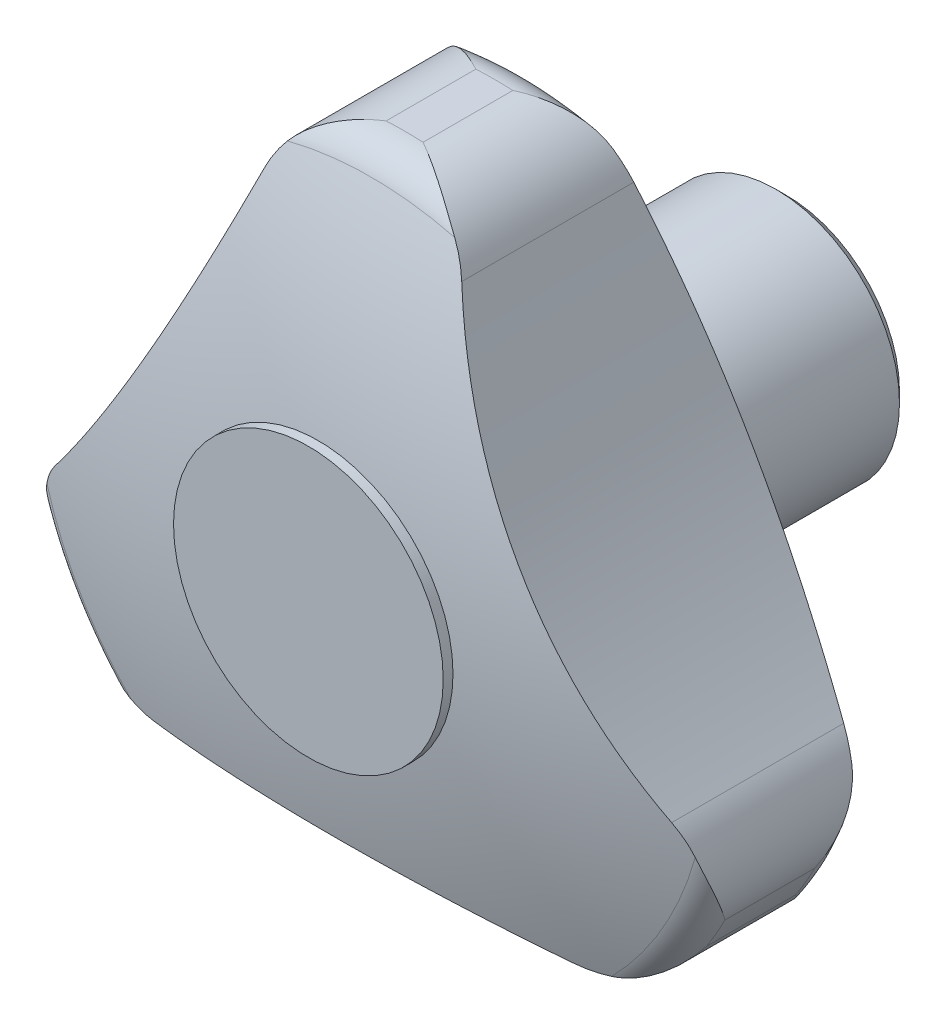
ISO-10303-21;
HEADER;
FILE_DESCRIPTION(('STEP AP214'),'2;1');
FILE_NAME('part.step','',(''),(''),'','','');
FILE_SCHEMA(('AUTOMOTIVE_DESIGN { 1 0 10303 214 1 1 1 1 }'));
ENDSEC;
DATA;
#1=APPLICATION_CONTEXT('core data for automotive mechanical design processes');
#2=APPLICATION_PROTOCOL_DEFINITION('international standard','automotive_design',2000,#1);
#3=PRODUCT_CONTEXT('',#1,'mechanical');
#4=PRODUCT('Part','Part','',(#3));
#5=PRODUCT_RELATED_PRODUCT_CATEGORY('part','',(#4));
#6=PRODUCT_DEFINITION_FORMATION('','',#4);
#7=PRODUCT_DEFINITION_CONTEXT('part definition',#1,'design');
#8=PRODUCT_DEFINITION('design','',#6,#7);
#9=PRODUCT_DEFINITION_SHAPE('','',#8);
#10=(LENGTH_UNIT() NAMED_UNIT(*) SI_UNIT(.MILLI.,.METRE.));
#11=(NAMED_UNIT(*) PLANE_ANGLE_UNIT() SI_UNIT($,.RADIAN.));
#12=(NAMED_UNIT(*) SI_UNIT($,.STERADIAN.) SOLID_ANGLE_UNIT());
#13=UNCERTAINTY_MEASURE_WITH_UNIT(LENGTH_MEASURE(1.E-05),#10,'distance_accuracy_value','');
#14=(GEOMETRIC_REPRESENTATION_CONTEXT(3) GLOBAL_UNCERTAINTY_ASSIGNED_CONTEXT((#13)) GLOBAL_UNIT_ASSIGNED_CONTEXT((#10,
#11,#12)) REPRESENTATION_CONTEXT('',''));
#15=CARTESIAN_POINT('',(0.,0.,0.));
#16=DIRECTION('',(0.,0.,1.));
#17=DIRECTION('',(1.,0.,0.));
#18=AXIS2_PLACEMENT_3D('',#15,#16,#17);
#19=CARTESIAN_POINT('',(0.,2.77555756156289E-13,-50.4999999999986));
#20=DIRECTION('',(0.,0.,1.));
#21=DIRECTION('',(0.,-1.,0.));
#22=AXIS2_PLACEMENT_3D('',#19,#20,#21);
#23=SPHERICAL_SURFACE('',#22,103.999999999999);
#24=CARTESIAN_POINT('',(9.30341411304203,36.2662225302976,46.5268395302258));
#25=CARTESIAN_POINT('',(9.48514389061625,36.0425927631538,46.5930047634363));
#26=CARTESIAN_POINT('',(9.65680365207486,35.8115267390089,46.6615574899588));
#27=CARTESIAN_POINT('',(9.97797395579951,35.3380282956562,46.80236289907));
#28=CARTESIAN_POINT('',(10.1276303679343,35.095686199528,46.8745865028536));
#29=CARTESIAN_POINT('',(10.405333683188,34.5999848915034,47.0225936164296));
#30=CARTESIAN_POINT('',(10.5333813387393,34.346626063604,47.0983770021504));
#31=CARTESIAN_POINT('',(10.7680546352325,33.8289090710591,47.2534728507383));
#32=CARTESIAN_POINT('',(10.8745238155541,33.5644862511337,47.3328063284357));
#33=CARTESIAN_POINT('',(10.9693896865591,33.2963396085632,47.413360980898));
#34=B_SPLINE_CURVE_WITH_KNOTS('',3,(#24,#25,#26,#27,#28,#29,#30,#31,#32,#33),.UNSPECIFIED.,.F.,
.F.,(4,2,2,2,4),(0.,0.88665818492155,1.76714402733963,2.64759920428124,3.53422637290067),.UNSPECIFIED.);
#35=CARTESIAN_POINT('',(9.30396328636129,36.2655465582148,46.5270395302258));
#36=VERTEX_POINT('',#35);
#37=CARTESIAN_POINT('',(10.9693189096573,33.2965396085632,47.4133008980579));
#38=VERTEX_POINT('',#37);
#39=EDGE_CURVE('E332',#36,#38,#34,.T.);
#40=ORIENTED_EDGE('',*,*,#39,.F.);
#41=CARTESIAN_POINT('',(0.,0.,46.5270395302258));
#42=DIRECTION('',(0.,0.,1.));
#43=DIRECTION('',(1.,0.,0.));
#44=AXIS2_PLACEMENT_3D('',#41,#42,#43);
#45=CIRCLE('',#44,37.44);
#46=CARTESIAN_POINT('',(-9.30396328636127,36.2655465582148,46.5270395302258));
#47=VERTEX_POINT('',#46);
#48=EDGE_CURVE('E172',#36,#47,#45,.T.);
#49=ORIENTED_EDGE('',*,*,#48,.T.);
#50=CARTESIAN_POINT('',(-10.969389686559,33.2963396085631,47.413360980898));
#51=CARTESIAN_POINT('',(-10.8745238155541,33.5644862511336,47.3328063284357));
#52=CARTESIAN_POINT('',(-10.7680546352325,33.8289090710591,47.2534728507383));
#53=CARTESIAN_POINT('',(-10.5333813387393,34.3466260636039,47.0983770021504));
#54=CARTESIAN_POINT('',(-10.405333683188,34.5999848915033,47.0225936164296));
#55=CARTESIAN_POINT('',(-10.1276303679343,35.0956861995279,46.8745865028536));
#56=CARTESIAN_POINT('',(-9.97797395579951,35.3380282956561,46.80236289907));
#57=CARTESIAN_POINT('',(-9.65680365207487,35.8115267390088,46.6615574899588));
#58=CARTESIAN_POINT('',(-9.48514389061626,36.0425927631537,46.5930047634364));
#59=CARTESIAN_POINT('',(-9.30341411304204,36.2662225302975,46.5268395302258));
#60=B_SPLINE_CURVE_WITH_KNOTS('',3,(#50,#51,#52,#53,#54,#55,#56,#57,#58,#59),.UNSPECIFIED.,.F.,
.F.,(4,2,2,2,4),(0.,0.886627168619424,1.76708234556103,2.64756818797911,3.53422637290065),.UNSPECIFIED.);
#61=CARTESIAN_POINT('',(-10.9693189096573,33.2965396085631,47.4133008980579));
#62=VERTEX_POINT('',#61);
#63=EDGE_CURVE('E323',#62,#47,#60,.T.);
#64=ORIENTED_EDGE('',*,*,#63,.F.);
#65=CARTESIAN_POINT('',(-10.9692481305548,33.2967396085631,47.4132408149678));
#66=CARTESIAN_POINT('',(-11.2987102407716,32.365714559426,47.6929493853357));
#67=CARTESIAN_POINT('',(-11.6406264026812,31.4338839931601,47.9553752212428));
#68=CARTESIAN_POINT('',(-12.349297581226,29.5703975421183,48.4451343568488));
#69=CARTESIAN_POINT('',(-12.7160537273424,28.6387416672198,48.672466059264));
#70=CARTESIAN_POINT('',(-13.474371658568,26.7773132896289,49.0915207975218));
#71=CARTESIAN_POINT('',(-13.8659377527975,25.8475411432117,49.2832376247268));
#72=CARTESIAN_POINT('',(-14.6735500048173,23.9919094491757,49.630560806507));
#73=CARTESIAN_POINT('',(-15.0895956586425,23.0660498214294,49.7861679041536));
#74=CARTESIAN_POINT('',(-15.9340357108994,21.2453954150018,50.0571314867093));
#75=CARTESIAN_POINT('',(-16.3617783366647,20.3504451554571,50.1734749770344));
#76=CARTESIAN_POINT('',(-17.2395590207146,18.5676638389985,50.3713858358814));
#77=CARTESIAN_POINT('',(-17.6895970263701,17.6798327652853,50.4529532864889));
#78=CARTESIAN_POINT('',(-18.6112868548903,15.9130800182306,50.5811082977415));
#79=CARTESIAN_POINT('',(-19.0829350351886,15.0341568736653,50.6277017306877));
#80=CARTESIAN_POINT('',(-20.047131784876,13.2867499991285,50.6858274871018));
#81=CARTESIAN_POINT('',(-20.5396801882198,12.4182661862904,50.6973600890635));
#82=CARTESIAN_POINT('',(-22.0055533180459,9.90270393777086,50.6797950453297));
#83=CARTESIAN_POINT('',(-23.0058802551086,8.2713575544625,50.6037870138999));
#84=CARTESIAN_POINT('',(-25.073415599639,5.06278721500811,50.323382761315));
#85=CARTESIAN_POINT('',(-26.1406307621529,3.48556875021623,50.1189735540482));
#86=CARTESIAN_POINT('',(-27.7997976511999,1.14667523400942,49.7138854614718));
#87=CARTESIAN_POINT('',(-28.3704410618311,0.361452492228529,49.5597486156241));
#88=CARTESIAN_POINT('',(-29.5259023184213,-1.19127140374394,49.2184404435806));
#89=CARTESIAN_POINT('',(-30.1107204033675,-1.95877225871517,49.0312685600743));
#90=CARTESIAN_POINT('',(-31.2931215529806,-3.47489219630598,48.6243215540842));
#91=CARTESIAN_POINT('',(-31.8907031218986,-4.2235134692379,48.404550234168));
#92=CARTESIAN_POINT('',(-33.0973270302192,-5.70109012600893,47.9328719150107));
#93=CARTESIAN_POINT('',(-33.7063689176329,-6.43004628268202,47.680966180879));
#94=CARTESIAN_POINT('',(-34.3204794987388,-7.1487609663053,47.4132263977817));
#95=B_SPLINE_CURVE_WITH_KNOTS('',3,(#65,#66,#67,#68,#69,#70,#71,#72,#73,#74,#75,#76,#77,#78,#79,
#80,#81,#82,#83,#84,#85,#86,#87,#88,#89,#90,#91,#92,#93,#94),.UNSPECIFIED.,.F.,.F.,(4,2,2,2,2,2,
2,2,2,2,2,2,2,2,4),(0.,3.07914254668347,6.15842519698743,9.23824414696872,12.3179997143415,
15.313276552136,18.3085463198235,21.3033130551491,24.2980560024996,30.0367874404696,
35.7760993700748,38.7239181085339,41.6717865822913,44.6193114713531,47.5667203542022),.UNSPECIFIED.);
#96=CARTESIAN_POINT('',(-34.3203086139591,-7.14856096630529,47.4133008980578));
#97=VERTEX_POINT('',#96);
#98=EDGE_CURVE('E331',#62,#97,#95,.T.);
#99=ORIENTED_EDGE('',*,*,#98,.T.);
#100=CARTESIAN_POINT('',(-36.059177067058,-10.0761183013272,46.5268395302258));
#101=CARTESIAN_POINT('',(-35.9563713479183,-9.80691675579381,46.5930057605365));
#102=CARTESIAN_POINT('',(-35.8420902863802,-9.54271812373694,46.6615595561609));
#103=CARTESIAN_POINT('',(-35.592609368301,-9.02781990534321,46.8023671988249));
#104=CARTESIAN_POINT('',(-35.4575606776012,-8.77703914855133,46.8745919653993));
#105=CARTESIAN_POINT('',(-35.16711687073,-8.28868390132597,47.0226014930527));
#106=CARTESIAN_POINT('',(-35.0117224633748,-8.0511089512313,47.098386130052));
#107=CARTESIAN_POINT('',(-34.6806963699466,-7.58901182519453,47.2534845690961));
#108=CARTESIAN_POINT('',(-34.5049304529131,-7.36459282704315,47.3328193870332));
#109=CARTESIAN_POINT('',(-34.3201377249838,-7.14836096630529,47.413375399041));
#110=B_SPLINE_CURVE_WITH_KNOTS('',3,(#100,#101,#102,#103,#104,#105,#106,#107,#108,#109),
.UNSPECIFIED.,.F.,.F.,(4,2,2,2,4),(0.,0.886671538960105,1.76717046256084,2.64763871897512,
3.53427923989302),.UNSPECIFIED.);
#111=CARTESIAN_POINT('',(-36.0588662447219,-10.0753047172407,46.5270395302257));
#112=VERTEX_POINT('',#111);
#113=EDGE_CURVE('E22',#112,#97,#110,.T.);
#114=ORIENTED_EDGE('',*,*,#113,.F.);
#115=CARTESIAN_POINT('',(-26.7549029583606,-26.190241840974,46.5270395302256));
#116=VERTEX_POINT('',#115);
#117=EDGE_CURVE('E680',#112,#116,#45,.T.);
#118=ORIENTED_EDGE('',*,*,#117,.T.);
#119=CARTESIAN_POINT('',(-22.8551626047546,-26.0429179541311,47.5581866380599));
#120=CARTESIAN_POINT('',(-22.9372116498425,-26.0624877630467,47.5338653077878));
#121=CARTESIAN_POINT('',(-23.0195259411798,-26.081024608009,47.5096387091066));
#122=CARTESIAN_POINT('',(-23.1847449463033,-26.1160390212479,47.4613588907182));
#123=CARTESIAN_POINT('',(-23.2676502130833,-26.1325142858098,47.4373058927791));
#124=CARTESIAN_POINT('',(-23.6290737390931,-26.1995795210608,47.3332019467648));
#125=CARTESIAN_POINT('',(-23.9099819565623,-26.2394758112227,47.2542286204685));
#126=CARTESIAN_POINT('',(-24.4751156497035,-26.2952916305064,47.0992472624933));
#127=CARTESIAN_POINT('',(-24.7593430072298,-26.3111968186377,47.0232410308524));
#128=CARTESIAN_POINT('',(-25.3294885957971,-26.3186693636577,46.8746967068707));
#129=CARTESIAN_POINT('',(-25.6154086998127,-26.3102008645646,46.8021638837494));
#130=CARTESIAN_POINT('',(-26.1866152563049,-26.2686407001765,46.6612407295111));
#131=CARTESIAN_POINT('',(-26.4719013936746,-26.2355387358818,46.5928521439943));
#132=CARTESIAN_POINT('',(-27.0261408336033,-26.1468279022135,46.4639625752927));
#133=CARTESIAN_POINT('',(-27.2952262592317,-26.0923628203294,46.403241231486));
#134=CARTESIAN_POINT('',(-27.8288539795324,-25.9612040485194,46.2866189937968));
#135=CARTESIAN_POINT('',(-28.0933984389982,-25.8845212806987,46.2307157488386));
#136=CARTESIAN_POINT('',(-28.6159621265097,-25.7092780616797,46.1242125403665));
#137=CARTESIAN_POINT('',(-28.8739870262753,-25.6107374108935,46.0736078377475));
#138=CARTESIAN_POINT('',(-29.381855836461,-25.3921965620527,45.9780886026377));
#139=CARTESIAN_POINT('',(-29.6317008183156,-25.2721991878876,45.9331733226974));
#140=CARTESIAN_POINT('',(-30.0781266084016,-25.0344106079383,45.8568263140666));
#141=CARTESIAN_POINT('',(-30.2763293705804,-24.9199635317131,45.8244136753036));
#142=CARTESIAN_POINT('',(-30.6648659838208,-24.6774247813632,45.7639291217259));
#143=CARTESIAN_POINT('',(-30.8552010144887,-24.5493351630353,45.7358565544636));
#144=CARTESIAN_POINT('',(-31.227189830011,-24.2799107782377,45.6842086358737));
#145=CARTESIAN_POINT('',(-31.4088347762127,-24.1385629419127,45.6606377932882));
#146=CARTESIAN_POINT('',(-31.7623103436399,-23.8433545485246,45.6181754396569));
#147=CARTESIAN_POINT('',(-31.9341385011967,-23.689490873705,45.5992850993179));
#148=CARTESIAN_POINT('',(-32.100547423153,-23.5297170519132,45.5828146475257));
#149=B_SPLINE_CURVE_WITH_KNOTS('',3,(#119,#120,#121,#122,#123,#124,#125,#126,#127,#128,#129,
#130,#131,#132,#133,#134,#135,#136,#137,#138,#139,#140,#141,#142,#143,#144,#145,#146,#147,#148),
.UNSPECIFIED.,.F.,.F.,(4,2,2,2,2,2,2,2,2,2,2,2,2,2,4),(0.,0.263337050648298,0.526965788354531,
1.40938240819,2.29232629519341,3.17656973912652,4.06118308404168,4.90377649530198,
5.74595639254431,6.58737647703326,7.42868590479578,8.12160209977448,8.81441402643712,
9.50791624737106,10.2015917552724),.UNSPECIFIED.);
#150=CARTESIAN_POINT('',(-23.3509897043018,-26.1479786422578,47.4133008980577));
#151=VERTEX_POINT('',#150);
#152=EDGE_CURVE('E144',#151,#116,#149,.T.);
#153=ORIENTED_EDGE('',*,*,#152,.F.);
#154=CARTESIAN_POINT('',(-23.3511897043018,-26.1480157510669,47.4132432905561));
#155=CARTESIAN_POINT('',(-22.380167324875,-25.9678258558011,47.6929517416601));
#156=CARTESIAN_POINT('',(-21.4022203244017,-25.7980187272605,47.9553774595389));
#157=CARTESIAN_POINT('',(-19.4340581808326,-25.4800028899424,48.4451363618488));
#158=CARTESIAN_POINT('',(-18.4438424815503,-25.3317951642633,48.672467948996));
#159=CARTESIAN_POINT('',(-16.4526393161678,-25.0578037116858,49.0915224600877));
#160=CARTESIAN_POINT('',(-15.4516500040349,-24.9320238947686,49.2832391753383));
#161=CARTESIAN_POINT('',(-13.4408197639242,-24.7036209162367,49.6305621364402));
#162=CARTESIAN_POINT('',(-12.4309790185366,-24.6009972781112,49.786169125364));
#163=CARTESIAN_POINT('',(-10.4320260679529,-24.421976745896,50.0571325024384));
#164=CARTESIAN_POINT('',(-9.44310509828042,-24.344937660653,50.1734758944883));
#165=CARTESIAN_POINT('',(-7.46028085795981,-24.213727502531,50.3713865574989));
#166=CARTESIAN_POINT('',(-6.4663775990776,-24.159556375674,50.4529539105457));
#167=CARTESIAN_POINT('',(-4.47547994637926,-24.074386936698,50.581108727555));
#168=CARTESIAN_POINT('',(-3.47848609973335,-24.0433847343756,50.6277020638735));
#169=CARTESIAN_POINT('',(-1.4830890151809,-24.0047003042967,50.6858276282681));
#170=CARTESIAN_POINT('',(-0.484685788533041,-23.9970178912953,50.6973601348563));
#171=CARTESIAN_POINT('',(2.4267859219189,-24.0087202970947,50.6797948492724));
#172=CARTESIAN_POINT('',(4.3397311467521,-24.0593554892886,50.6037870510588));
#173=CARTESIAN_POINT('',(8.15219102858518,-24.2456076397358,50.3233840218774));
#174=CARTESIAN_POINT('',(10.0517043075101,-24.3812331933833,50.1189758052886));
#175=CARTESIAN_POINT('',(12.906820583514,-24.6486657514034,49.7138897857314));
#176=CARTESIAN_POINT('',(13.8721622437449,-24.7502455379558,49.5597537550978));
#177=CARTESIAN_POINT('',(15.7945855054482,-24.9745412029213,49.2184474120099));
#178=CARTESIAN_POINT('',(16.7516669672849,-25.0972574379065,49.031276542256));
#179=CARTESIAN_POINT('',(18.6558603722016,-25.3631854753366,48.6243317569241));
#180=CARTESIAN_POINT('',(19.6029734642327,-25.5063948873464,48.4045616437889));
#181=CARTESIAN_POINT('',(21.485898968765,-25.8125718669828,47.9328859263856));
#182=CARTESIAN_POINT('',(22.4217118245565,-25.9755386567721,47.6809815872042));
#183=CARTESIAN_POINT('',(23.3511897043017,-26.1480157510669,47.4132432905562));
#184=B_SPLINE_CURVE_WITH_KNOTS('',3,(#154,#155,#156,#157,#158,#159,#160,#161,#162,#163,#164,
#165,#166,#167,#168,#169,#170,#171,#172,#173,#174,#175,#176,#177,#178,#179,#180,#181,#182,#183),
.UNSPECIFIED.,.F.,.F.,(4,2,2,2,2,2,2,2,2,2,2,2,2,2,4),(0.,3.07914235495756,6.15842481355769,
9.2382435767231,12.3179989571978,15.3132757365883,18.3085454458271,21.3033121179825,
24.2980550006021,30.0367695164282,35.7760645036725,38.723874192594,41.6717336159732,
44.6192494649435,47.5666493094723),.UNSPECIFIED.);
#185=CARTESIAN_POINT('',(23.3509897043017,-26.1479786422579,47.4133008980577));
#186=VERTEX_POINT('',#185);
#187=EDGE_CURVE('E206',#151,#186,#184,.T.);
#188=ORIENTED_EDGE('',*,*,#187,.T.);
#189=CARTESIAN_POINT('',(32.100547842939,-23.529716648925,45.5828146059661));
#190=CARTESIAN_POINT('',(31.904118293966,-23.7183328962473,45.60225297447));
#191=CARTESIAN_POINT('',(31.7001269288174,-23.8986968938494,45.6250691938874));
#192=CARTESIAN_POINT('',(31.2786731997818,-24.241842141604,45.6771908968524));
#193=CARTESIAN_POINT('',(31.0612126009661,-24.4046256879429,45.706495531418));
#194=CARTESIAN_POINT('',(30.6152304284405,-24.7110254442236,45.7712153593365));
#195=CARTESIAN_POINT('',(30.3867517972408,-24.8547089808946,45.8066080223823));
#196=CARTESIAN_POINT('',(29.9196974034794,-25.1227772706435,45.8832543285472));
#197=CARTESIAN_POINT('',(29.6811223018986,-25.2471632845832,45.9245075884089));
#198=CARTESIAN_POINT('',(29.2248404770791,-25.4622009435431,46.007213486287));
#199=CARTESIAN_POINT('',(29.0080806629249,-25.5551111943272,46.0480438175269));
#200=CARTESIAN_POINT('',(28.5691888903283,-25.725189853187,46.133706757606));
#201=CARTESIAN_POINT('',(28.3470558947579,-25.8023551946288,46.1785401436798));
#202=CARTESIAN_POINT('',(27.8984015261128,-25.9407469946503,46.2719700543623));
#203=CARTESIAN_POINT('',(27.6718759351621,-26.0019572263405,46.3205703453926));
#204=CARTESIAN_POINT('',(27.2158058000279,-26.1081902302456,46.4212034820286));
#205=CARTESIAN_POINT('',(26.9862610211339,-26.1532117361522,46.4732365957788));
#206=CARTESIAN_POINT('',(26.4720061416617,-26.2355210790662,46.5928279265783));
#207=CARTESIAN_POINT('',(26.1868046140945,-26.2686183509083,46.6611953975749));
#208=CARTESIAN_POINT('',(25.6157180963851,-26.3101869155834,46.8020861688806));
#209=CARTESIAN_POINT('',(25.3298332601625,-26.3186633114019,46.8746086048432));
#210=CARTESIAN_POINT('',(24.7596553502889,-26.3112114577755,47.0231579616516));
#211=CARTESIAN_POINT('',(24.4753608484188,-26.2953106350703,47.0991808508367));
#212=CARTESIAN_POINT('',(23.9101003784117,-26.2394927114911,47.2541953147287));
#213=CARTESIAN_POINT('',(23.6291324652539,-26.1995904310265,47.3331850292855));
#214=CARTESIAN_POINT('',(23.2676464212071,-26.1325135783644,47.4373069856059));
#215=CARTESIAN_POINT('',(23.1847373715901,-26.1160375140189,47.461361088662));
#216=CARTESIAN_POINT('',(23.0195186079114,-26.0810229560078,47.5096408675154));
#217=CARTESIAN_POINT('',(22.9372082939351,-26.0624869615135,47.5338663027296));
#218=CARTESIAN_POINT('',(22.855163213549,-26.0429180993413,47.5581864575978));
#219=B_SPLINE_CURVE_WITH_KNOTS('',3,(#189,#190,#191,#192,#193,#194,#195,#196,#197,#198,#199,
#200,#201,#202,#203,#204,#205,#206,#207,#208,#209,#210,#211,#212,#213,#214,#215,#216,#217,#218),
.UNSPECIFIED.,.F.,.F.,(4,2,2,2,2,2,2,2,2,2,2,2,2,2,4),(0.,0.818776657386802,1.63744624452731,
2.45314887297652,3.26879818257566,3.9862201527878,4.70378172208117,5.42207025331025,
6.14041495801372,7.0247399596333,7.90888166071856,8.79202934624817,9.67463226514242,
9.93827305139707,10.2015974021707),.UNSPECIFIED.);
#220=CARTESIAN_POINT('',(26.7549029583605,-26.190241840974,46.5270395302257));
#221=VERTEX_POINT('',#220);
#222=EDGE_CURVE('E468',#221,#186,#219,.T.);
#223=ORIENTED_EDGE('',*,*,#222,.F.);
#224=CARTESIAN_POINT('',(36.0588662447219,-10.0753047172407,46.5270395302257));
#225=VERTEX_POINT('',#224);
#226=EDGE_CURVE('E503',#221,#225,#45,.T.);
#227=ORIENTED_EDGE('',*,*,#226,.T.);
#228=CARTESIAN_POINT('',(34.3201377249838,-7.14836096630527,47.413375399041));
#229=CARTESIAN_POINT('',(34.5049304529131,-7.36459282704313,47.3328193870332));
#230=CARTESIAN_POINT('',(34.6806963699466,-7.5890118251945,47.2534845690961));
#231=CARTESIAN_POINT('',(35.0117224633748,-8.05110895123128,47.098386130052));
#232=CARTESIAN_POINT('',(35.16711687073,-8.28868390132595,47.0226014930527));
#233=CARTESIAN_POINT('',(35.4575606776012,-8.77703914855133,46.8745919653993));
#234=CARTESIAN_POINT('',(35.5926093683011,-9.02781990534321,46.8023671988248));
#235=CARTESIAN_POINT('',(35.8420902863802,-9.54271812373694,46.6615595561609));
#236=CARTESIAN_POINT('',(35.9563713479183,-9.80691675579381,46.5930057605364));
#237=CARTESIAN_POINT('',(36.0591770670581,-10.0761183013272,46.5268395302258));
#238=B_SPLINE_CURVE_WITH_KNOTS('',3,(#228,#229,#230,#231,#232,#233,#234,#235,#236,#237),
.UNSPECIFIED.,.F.,.F.,(4,2,2,2,4),(0.,0.88664052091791,1.76710877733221,2.64760770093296,
3.53427923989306),.UNSPECIFIED.);
#239=CARTESIAN_POINT('',(34.3203086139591,-7.14856096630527,47.4133008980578));
#240=VERTEX_POINT('',#239);
#241=EDGE_CURVE('E425',#240,#225,#238,.T.);
#242=ORIENTED_EDGE('',*,*,#241,.F.);
#243=CARTESIAN_POINT('',(34.3204794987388,-7.14876096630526,47.4132263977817));
#244=CARTESIAN_POINT('',(33.6789190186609,-6.39792626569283,47.6929355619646));
#245=CARTESIAN_POINT('',(33.042887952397,-5.63590327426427,47.9553619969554));
#246=CARTESIAN_POINT('',(31.7833964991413,-4.09043353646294,48.4451223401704));
#247=CARTESIAN_POINT('',(31.1599366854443,-3.30698581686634,48.6724546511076));
#248=CARTESIAN_POINT('',(29.9270508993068,-1.7195497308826,49.0915106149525));
#249=CARTESIAN_POINT('',(29.3176273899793,-0.915557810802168,49.2832280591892));
#250=CARTESIAN_POINT('',(28.1144087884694,0.711670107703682,49.6305524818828));
#251=CARTESIAN_POINT('',(27.5206133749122,1.53490570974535,49.7861602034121));
#252=CARTESIAN_POINT('',(26.366099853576,3.1765388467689,50.0571250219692));
#253=CARTESIAN_POINT('',(25.8049212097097,3.99444966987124,50.1734691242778));
#254=CARTESIAN_POINT('',(24.6998770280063,5.64602014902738,50.3713812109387));
#255=CARTESIAN_POINT('',(24.1560114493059,6.47967976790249,50.452949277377));
#256=CARTESIAN_POINT('',(23.0868029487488,8.16126244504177,50.5811055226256));
#257=CARTESIAN_POINT('',(22.5614569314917,9.00918308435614,50.6276995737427));
#258=CARTESIAN_POINT('',(21.5302558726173,10.7179049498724,50.6858265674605));
#259=CARTESIAN_POINT('',(21.0244006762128,11.5787060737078,50.6973597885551));
#260=CARTESIAN_POINT('',(19.5787953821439,14.1059699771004,50.6797965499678));
#261=CARTESIAN_POINT('',(18.6661707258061,15.7879513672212,50.6037897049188));
#262=CARTESIAN_POINT('',(16.9212335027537,19.1827740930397,50.3233878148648));
#263=CARTESIAN_POINT('',(16.0889290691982,20.8956185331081,50.1189797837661));
#264=CARTESIAN_POINT('',(14.8929701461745,23.5019456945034,49.7138934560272));
#265=CARTESIAN_POINT('',(14.4982686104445,24.3887486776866,49.5597572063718));
#266=CARTESIAN_POINT('',(13.7313000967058,26.1657693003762,49.2184502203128));
#267=CARTESIAN_POINT('',(13.3590334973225,27.0559869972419,49.0312789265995));
#268=CARTESIAN_POINT('',(12.6372348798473,28.8380363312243,48.6243330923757));
#269=CARTESIAN_POINT('',(12.2877002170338,29.7298677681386,48.4045623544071));
#270=CARTESIAN_POINT('',(11.6113924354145,31.5136230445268,47.9328851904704));
#271=CARTESIAN_POINT('',(11.2846184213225,32.4055468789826,47.680980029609));
#272=CARTESIAN_POINT('',(10.9692481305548,33.2967396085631,47.4132408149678));
#273=B_SPLINE_CURVE_WITH_KNOTS('',3,(#243,#244,#245,#246,#247,#248,#249,#250,#251,#252,#253,
#254,#255,#256,#257,#258,#259,#260,#261,#262,#263,#264,#265,#266,#267,#268,#269,#270,#271,#272),
.UNSPECIFIED.,.F.,.F.,(4,2,2,2,2,2,2,2,2,2,2,2,2,2,4),(0.,3.07914255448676,6.15842521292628,
9.2382441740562,12.3179997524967,15.313276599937,18.3085463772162,21.3033131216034,
24.2980560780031,30.03678749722,35.7760994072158,38.7239181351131,41.6717865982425,
44.6193114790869,47.5667203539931),.UNSPECIFIED.);
#274=EDGE_CURVE('E499',#240,#38,#273,.T.);
#275=ORIENTED_EDGE('',*,*,#274,.T.);
#276=EDGE_LOOP('',(#40,#49,#64,#99,#114,#118,#153,#188,#223,#227,#242,#275));
#277=FACE_BOUND('',#276,.T.);
#278=CARTESIAN_POINT('',(0.,0.,52.4125842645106));
#279=DIRECTION('',(0.,0.,-1.));
#280=DIRECTION('',(-1.,0.,0.));
#281=AXIS2_PLACEMENT_3D('',#278,#279,#280);
#282=CIRCLE('',#281,15.);
#283=CARTESIAN_POINT('',(-15.,0.,52.4125842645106));
#284=VERTEX_POINT('',#283);
#285=EDGE_CURVE('E9',#284,#284,#282,.T.);
#286=ORIENTED_EDGE('',*,*,#285,.T.);
#287=EDGE_LOOP('',(#286));
#288=FACE_BOUND('',#287,.T.);
#289=ADVANCED_FACE('F14',(#277,#288),#23,.T.);
#290=CARTESIAN_POINT('',(0.,0.,32.8123490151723));
#291=DIRECTION('',(0.,0.,1.));
#292=DIRECTION('',(1.,0.,0.));
#293=AXIS2_PLACEMENT_3D('',#290,#291,#292);
#294=TOROIDAL_SURFACE('',#293,36.,4.);
#295=CARTESIAN_POINT('',(-35.9801575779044,-9.87575602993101,29.0332519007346));
#296=CARTESIAN_POINT('',(-36.0259792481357,-9.98837235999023,29.0589236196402));
#297=CARTESIAN_POINT('',(-36.06958909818,-10.101437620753,29.0864524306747));
#298=CARTESIAN_POINT('',(-36.152409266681,-10.3282719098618,29.144911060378));
#299=CARTESIAN_POINT('',(-36.1916204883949,-10.4420407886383,29.1758401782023));
#300=CARTESIAN_POINT('',(-36.3026076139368,-10.7838378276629,29.2731775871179));
#301=CARTESIAN_POINT('',(-36.3678748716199,-11.0126968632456,29.3442151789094));
#302=CARTESIAN_POINT('',(-36.4811001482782,-11.4701431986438,29.4961478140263));
#303=CARTESIAN_POINT('',(-36.52913454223,-11.6987271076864,29.5769971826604));
#304=CARTESIAN_POINT('',(-36.6087997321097,-12.1557063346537,29.7471258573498));
#305=CARTESIAN_POINT('',(-36.6404226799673,-12.3841015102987,29.8364091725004));
#306=CARTESIAN_POINT('',(-36.6949009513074,-12.9088851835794,30.0501050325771));
#307=CARTESIAN_POINT('',(-36.712183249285,-13.2048737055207,30.1769557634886));
#308=CARTESIAN_POINT('',(-36.7207591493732,-13.7930340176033,30.4398055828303));
#309=CARTESIAN_POINT('',(-36.7120475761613,-14.0852050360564,30.575806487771));
#310=CARTESIAN_POINT('',(-36.6483307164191,-14.9549307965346,30.9948167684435));
#311=CARTESIAN_POINT('',(-36.5556828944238,-15.5250711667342,31.2885714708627));
#312=CARTESIAN_POINT('',(-36.3250543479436,-16.4441043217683,31.7873414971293));
#313=CARTESIAN_POINT('',(-36.213283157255,-16.8021802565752,31.9884816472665));
#314=CARTESIAN_POINT('',(-35.9512754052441,-17.501600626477,32.3935479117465));
#315=CARTESIAN_POINT('',(-35.8011186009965,-17.8429780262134,32.5974674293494));
#316=CARTESIAN_POINT('',(-35.6295101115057,-18.1806942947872,32.8049530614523));
#317=CARTESIAN_POINT('',(-35.6264454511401,-18.1867102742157,32.8086510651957));
#318=CARTESIAN_POINT('',(-35.6233747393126,-18.1927230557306,32.8123490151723));
#319=B_SPLINE_CURVE_WITH_KNOTS('',3,(#295,#296,#297,#298,#299,#300,#301,#302,#303,#304,#305,
#306,#307,#308,#309,#310,#311,#312,#313,#314,#315,#316,#317,#318),.UNSPECIFIED.,.F.,.F.,(4,2,2,
2,2,2,2,2,2,2,2,4),(0.,0.372708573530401,0.745340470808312,1.48948087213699,2.23028131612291,
2.97143569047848,3.93750896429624,4.90377459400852,6.83832849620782,8.1135947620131,
9.38623253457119,9.40932655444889),.UNSPECIFIED.);
#320=CARTESIAN_POINT('',(-35.9805145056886,-9.87663337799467,29.0334519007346));
#321=VERTEX_POINT('',#320);
#322=CARTESIAN_POINT('',(-35.6233750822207,-18.1927223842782,32.8123490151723));
#323=VERTEX_POINT('',#322);
#324=EDGE_CURVE('E451',#321,#323,#319,.T.);
#325=ORIENTED_EDGE('',*,*,#324,.F.);
#326=CARTESIAN_POINT('',(0.,0.,29.0334519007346));
#327=DIRECTION('',(0.,0.,1.));
#328=DIRECTION('',(1.,0.,0.));
#329=AXIS2_PLACEMENT_3D('',#326,#327,#328);
#330=CIRCLE('',#329,37.3114635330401);
#331=CARTESIAN_POINT('',(-26.543672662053,-26.2217229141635,29.0334519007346));
#332=VERTEX_POINT('',#331);
#333=EDGE_CURVE('E184',#321,#332,#330,.T.);
#334=ORIENTED_EDGE('',*,*,#333,.T.);
#335=CARTESIAN_POINT('',(-33.5670476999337,-21.7543859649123,32.8123490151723));
#336=CARTESIAN_POINT('',(-33.5633758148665,-21.7600516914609,32.8086510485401));
#337=CARTESIAN_POINT('',(-33.559698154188,-21.7657137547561,32.8049530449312));
#338=CARTESIAN_POINT('',(-33.3941011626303,-22.0200995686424,32.6386996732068));
#339=CARTESIAN_POINT('',(-33.2210387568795,-22.2617307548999,32.4760920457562));
#340=CARTESIAN_POINT('',(-32.8535263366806,-22.7292991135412,32.1524040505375));
#341=CARTESIAN_POINT('',(-32.6590693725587,-22.9552311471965,31.9913241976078));
#342=CARTESIAN_POINT('',(-32.2489294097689,-23.3906218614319,31.6718216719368));
#343=CARTESIAN_POINT('',(-32.0331867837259,-23.6000311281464,31.5134080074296));
#344=CARTESIAN_POINT('',(-31.5817563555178,-24.0000629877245,31.2015149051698));
#345=CARTESIAN_POINT('',(-31.3460747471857,-24.1906913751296,31.0480339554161));
#346=CARTESIAN_POINT('',(-30.8870681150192,-24.5283371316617,30.7672718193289));
#347=CARTESIAN_POINT('',(-30.6660547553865,-24.6778099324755,30.639160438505));
#348=CARTESIAN_POINT('',(-30.2099438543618,-24.9601026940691,30.3896783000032));
#349=CARTESIAN_POINT('',(-29.9748446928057,-25.0929207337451,30.2683083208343));
#350=CARTESIAN_POINT('',(-29.491946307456,-25.3401902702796,30.0344946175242));
#351=CARTESIAN_POINT('',(-29.2441865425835,-25.4546947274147,29.9220256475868));
#352=CARTESIAN_POINT('',(-28.7362449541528,-25.6643187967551,29.7078552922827));
#353=CARTESIAN_POINT('',(-28.4760697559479,-25.7594486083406,29.6061482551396));
#354=CARTESIAN_POINT('',(-27.942860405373,-25.9292819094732,29.4156317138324));
#355=CARTESIAN_POINT('',(-27.6697667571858,-26.0038773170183,29.3268915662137));
#356=CARTESIAN_POINT('',(-27.1133213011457,-26.1303372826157,29.1663059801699));
#357=CARTESIAN_POINT('',(-26.8299682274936,-26.1821990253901,29.0944626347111));
#358=CARTESIAN_POINT('',(-26.3790130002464,-26.2444546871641,28.9983621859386));
#359=CARTESIAN_POINT('',(-26.2140307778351,-26.2630905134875,28.9669269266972));
#360=CARTESIAN_POINT('',(-25.8820635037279,-26.2921715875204,28.9119066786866));
#361=CARTESIAN_POINT('',(-25.7150790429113,-26.3026191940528,28.888319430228));
#362=CARTESIAN_POINT('',(-25.3796701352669,-26.3151099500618,28.8500320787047));
#363=CARTESIAN_POINT('',(-25.2112449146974,-26.317148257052,28.8353371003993));
#364=CARTESIAN_POINT('',(-24.8739298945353,-26.3126697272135,28.8160357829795));
#365=CARTESIAN_POINT('',(-24.7050401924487,-26.3061545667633,28.8114274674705));
#366=CARTESIAN_POINT('',(-24.3928363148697,-26.2861702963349,28.8134170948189));
#367=CARTESIAN_POINT('',(-24.2494370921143,-26.2738733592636,28.8184571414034));
#368=CARTESIAN_POINT('',(-23.963912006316,-26.2431847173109,28.8376195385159));
#369=CARTESIAN_POINT('',(-23.8217858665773,-26.2247943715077,28.8517398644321));
#370=CARTESIAN_POINT('',(-23.5401123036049,-26.1822196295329,28.8898518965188));
#371=CARTESIAN_POINT('',(-23.40055914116,-26.1580504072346,28.9138178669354));
#372=CARTESIAN_POINT('',(-23.1248223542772,-26.1043186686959,28.9724114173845));
#373=CARTESIAN_POINT('',(-22.9886366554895,-26.0747595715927,29.0070322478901));
#374=CARTESIAN_POINT('',(-22.7731138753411,-26.0233443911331,29.0718991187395));
#375=CARTESIAN_POINT('',(-22.6923318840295,-26.0029838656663,29.0985799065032));
#376=CARTESIAN_POINT('',(-22.5327547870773,-25.9606773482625,29.1562957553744));
#377=CARTESIAN_POINT('',(-22.4539598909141,-25.9387311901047,29.187331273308));
#378=CARTESIAN_POINT('',(-22.3763053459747,-25.9160867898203,29.2206084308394));
#379=B_SPLINE_CURVE_WITH_KNOTS('',3,(#335,#336,#337,#338,#339,#340,#341,#342,#343,#344,#345,
#346,#347,#348,#349,#350,#351,#352,#353,#354,#355,#356,#357,#358,#359,#360,#361,#362,#363,#364,
#365,#366,#367,#368,#369,#370,#371,#372,#373,#374,#375,#376,#377,#378),.UNSPECIFIED.,.F.,.F.,(4,
2,2,2,2,2,2,2,2,2,2,2,2,2,2,2,2,2,2,2,2,4),(0.,0.0230940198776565,1.0382441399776,
2.05372499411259,3.07213595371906,4.0902317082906,4.97733649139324,5.86454350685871,
6.74913655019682,7.63326270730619,8.52195712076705,9.41076155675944,9.91737422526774,
10.4238408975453,10.9305991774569,11.4372581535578,11.8689156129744,12.3004768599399,
12.7309171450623,13.1610853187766,13.42338163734,13.6857054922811),.UNSPECIFIED.);
#380=CARTESIAN_POINT('',(-33.5670473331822,-21.7543865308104,32.8123490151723));
#381=VERTEX_POINT('',#380);
#382=EDGE_CURVE('E149',#381,#332,#379,.T.);
#383=ORIENTED_EDGE('',*,*,#382,.F.);
#384=CARTESIAN_POINT('',(0.,0.,32.8123490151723));
#385=DIRECTION('',(0.,0.,1.));
#386=DIRECTION('',(1.,0.,0.));
#387=AXIS2_PLACEMENT_3D('',#384,#385,#386);
#388=CIRCLE('',#387,40.);
#389=EDGE_CURVE('E159',#323,#381,#388,.T.);
#390=ORIENTED_EDGE('',*,*,#389,.F.);
#391=EDGE_LOOP('',(#325,#334,#383,#390));
#392=FACE_BOUND('',#391,.T.);
#393=ADVANCED_FACE('F253',(#392),#294,.T.);
#394=CARTESIAN_POINT('',(35.6233747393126,-18.1927230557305,32.8123490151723));
#395=CARTESIAN_POINT('',(35.6264454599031,-18.1867102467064,32.8086510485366));
#396=CARTESIAN_POINT('',(35.629510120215,-18.1806942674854,32.8049530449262));
#397=CARTESIAN_POINT('',(35.7670038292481,-17.9101145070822,32.6387146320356));
#398=CARTESIAN_POINT('',(35.8897211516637,-17.6394479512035,32.4761219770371));
#399=CARTESIAN_POINT('',(36.1108751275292,-17.0874414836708,32.1524635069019));
#400=CARTESIAN_POINT('',(36.2093038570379,-16.8060981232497,31.9913982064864));
#401=CARTESIAN_POINT('',(36.3813024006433,-16.2332150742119,31.6718948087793));
#402=CARTESIAN_POINT('',(36.454795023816,-15.9416467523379,31.5134662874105));
#403=CARTESIAN_POINT('',(36.5755335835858,-15.3506279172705,31.201543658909));
#404=CARTESIAN_POINT('',(36.6227875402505,-15.0511798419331,31.0480480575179));
#405=CARTESIAN_POINT('',(36.6857091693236,-14.4847081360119,30.7672178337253));
#406=CARTESIAN_POINT('',(36.7046531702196,-14.2184574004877,30.6390545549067));
#407=CARTESIAN_POINT('',(36.721059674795,-13.6820870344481,30.3894768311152));
#408=CARTESIAN_POINT('',(36.7185199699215,-13.4119670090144,30.2680630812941));
#409=CARTESIAN_POINT('',(36.6911754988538,-12.8701303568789,30.0342656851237));
#410=CARTESIAN_POINT('',(36.6664547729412,-12.5984235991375,29.9218496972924));
#411=CARTESIAN_POINT('',(36.5940398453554,-12.0539536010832,29.7077785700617));
#412=CARTESIAN_POINT('',(36.5463567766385,-11.7811909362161,29.6061182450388));
#413=CARTESIAN_POINT('',(36.4269011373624,-11.2348495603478,29.4157240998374));
#414=CARTESIAN_POINT('',(36.3550208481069,-10.9612727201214,29.3270506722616));
#415=CARTESIAN_POINT('',(36.2286187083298,-10.5526796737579,29.2066636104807));
#416=CARTESIAN_POINT('',(36.1833254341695,-10.4166232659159,29.1686022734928));
#417=CARTESIAN_POINT('',(36.0864624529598,-10.1454185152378,29.0972287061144));
#418=CARTESIAN_POINT('',(36.034889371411,-10.0102707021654,29.0639190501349));
#419=CARTESIAN_POINT('',(35.9801575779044,-9.875756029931,29.0332519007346));
#420=B_SPLINE_CURVE_WITH_KNOTS('',3,(#394,#395,#396,#397,#398,#399,#400,#401,#402,#403,#404,
#405,#406,#407,#408,#409,#410,#411,#412,#413,#414,#415,#416,#417,#418,#419),.UNSPECIFIED.,.F.,
.F.,(4,2,2,2,2,2,2,2,2,2,2,2,4),(0.,0.0230940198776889,1.03815072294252,2.05353814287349,
3.07204066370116,4.09023169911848,4.9777024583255,5.86526445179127,6.74947775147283,
7.63326278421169,8.52103536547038,8.96593722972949,9.4110792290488),.UNSPECIFIED.);
#421=CARTESIAN_POINT('',(35.6233747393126,-18.1927230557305,32.8123490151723));
#422=VERTEX_POINT('',#421);
#423=CARTESIAN_POINT('',(35.9805145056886,-9.87663337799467,29.0334519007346));
#424=VERTEX_POINT('',#423);
#425=EDGE_CURVE('E272',#422,#424,#420,.T.);
#426=ORIENTED_EDGE('',*,*,#425,.F.);
#427=CARTESIAN_POINT('',(33.5670481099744,-21.754385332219,32.8123490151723));
#428=VERTEX_POINT('',#427);
#429=EDGE_CURVE('E170',#428,#422,#388,.T.);
#430=ORIENTED_EDGE('',*,*,#429,.F.);
#431=CARTESIAN_POINT('',(22.3763053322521,-25.9160867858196,29.2206084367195));
#432=CARTESIAN_POINT('',(22.4953111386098,-25.950811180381,29.1695962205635));
#433=CARTESIAN_POINT('',(22.6170011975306,-25.9838621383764,29.1238708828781));
#434=CARTESIAN_POINT('',(22.8645397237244,-26.0459780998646,29.0425260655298));
#435=CARTESIAN_POINT('',(22.9903830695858,-26.0750478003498,29.0068946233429));
#436=CARTESIAN_POINT('',(23.2445678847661,-26.1284923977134,28.945329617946));
#437=CARTESIAN_POINT('',(23.3728906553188,-26.1528935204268,28.9193410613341));
#438=CARTESIAN_POINT('',(23.6318560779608,-26.196835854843,28.8761393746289));
#439=CARTESIAN_POINT('',(23.7624995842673,-26.2163752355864,28.8589295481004));
#440=CARTESIAN_POINT('',(24.0613158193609,-26.2549823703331,28.8290343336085));
#441=CARTESIAN_POINT('',(24.2299518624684,-26.2724501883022,28.8188853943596));
#442=CARTESIAN_POINT('',(24.5682646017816,-26.2987925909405,28.8104153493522));
#443=CARTESIAN_POINT('',(24.7379419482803,-26.307661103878,28.8121025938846));
#444=CARTESIAN_POINT('',(25.0772391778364,-26.3167504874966,28.8260025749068));
#445=CARTESIAN_POINT('',(25.2468588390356,-26.3169628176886,28.8382256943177));
#446=CARTESIAN_POINT('',(25.5848713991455,-26.3088274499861,28.8719762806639));
#447=CARTESIAN_POINT('',(25.7532648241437,-26.300483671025,28.8934994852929));
#448=CARTESIAN_POINT('',(26.0252624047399,-26.2801530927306,28.935117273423));
#449=CARTESIAN_POINT('',(26.1294557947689,-26.2707100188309,28.9527145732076));
#450=CARTESIAN_POINT('',(26.3368413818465,-26.248646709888,28.9908404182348));
#451=CARTESIAN_POINT('',(26.4400345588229,-26.2360300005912,29.0113656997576));
#452=CARTESIAN_POINT('',(26.7821614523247,-26.1888000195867,29.0842758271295));
#453=CARTESIAN_POINT('',(27.0189071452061,-26.1472644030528,29.142696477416));
#454=CARTESIAN_POINT('',(27.4856965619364,-26.0481591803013,29.2718014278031));
#455=CARTESIAN_POINT('',(27.7157349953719,-25.9905772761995,29.3424951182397));
#456=CARTESIAN_POINT('',(28.1689303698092,-25.8601017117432,29.4943362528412));
#457=CARTESIAN_POINT('',(28.3920571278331,-25.7871494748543,29.5755232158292));
#458=CARTESIAN_POINT('',(28.82972278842,-25.6270409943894,29.7463615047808));
#459=CARTESIAN_POINT('',(29.0442626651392,-25.5398863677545,29.8360118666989));
#460=CARTESIAN_POINT('',(29.5272056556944,-25.324124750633,30.0502528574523));
#461=CARTESIAN_POINT('',(29.79249658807,-25.1909205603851,30.1772664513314));
#462=CARTESIAN_POINT('',(30.3067796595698,-24.9038412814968,30.4404831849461));
#463=CARTESIAN_POINT('',(30.5557657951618,-24.7499586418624,30.5766896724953));
#464=CARTESIAN_POINT('',(31.2766851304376,-24.2599648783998,30.9955852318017));
#465=CARTESIAN_POINT('',(31.7234830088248,-23.8950958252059,31.2889639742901));
#466=CARTESIAN_POINT('',(32.4034827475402,-23.2364223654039,31.7873000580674));
#467=CARTESIAN_POINT('',(32.6576509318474,-22.9606475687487,31.9883981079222));
#468=CARTESIAN_POINT('',(33.1323769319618,-22.3840423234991,32.3934632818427));
#469=CARTESIAN_POINT('',(33.3529894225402,-22.0832538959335,32.5974251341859));
#470=CARTESIAN_POINT('',(33.5596981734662,-21.7657137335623,32.804953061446));
#471=CARTESIAN_POINT('',(33.5633758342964,-21.7600516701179,32.8086510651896));
#472=CARTESIAN_POINT('',(33.5670476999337,-21.7543859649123,32.8123490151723));
#473=B_SPLINE_CURVE_WITH_KNOTS('',3,(#431,#432,#433,#434,#435,#436,#437,#438,#439,#440,#441,
#442,#443,#444,#445,#446,#447,#448,#449,#450,#451,#452,#453,#454,#455,#456,#457,#458,#459,#460,
#461,#462,#463,#464,#465,#466,#467,#468,#469,#470,#471,#472),.UNSPECIFIED.,.F.,.F.,(4,2,2,2,2,2,
2,2,2,2,2,2,2,2,2,2,2,2,2,2,4),(0.,0.401930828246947,0.803383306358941,1.20250976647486,
1.60178631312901,2.11059926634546,2.61977121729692,3.1294455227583,3.63888648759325,
3.95706854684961,4.27489867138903,5.0158651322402,5.75740103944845,6.50181579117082,
7.24614585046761,8.21340216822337,9.18101265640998,11.1130444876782,12.3880466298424,
13.6609485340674,13.6840425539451),.UNSPECIFIED.);
#474=CARTESIAN_POINT('',(26.5436726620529,-26.2217229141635,29.0334519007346));
#475=VERTEX_POINT('',#474);
#476=EDGE_CURVE('E263',#475,#428,#473,.T.);
#477=ORIENTED_EDGE('',*,*,#476,.F.);
#478=EDGE_CURVE('E179',#475,#424,#330,.T.);
#479=ORIENTED_EDGE('',*,*,#478,.T.);
#480=EDGE_LOOP('',(#426,#430,#477,#479));
#481=FACE_BOUND('',#480,.T.);
#482=ADVANCED_FACE('F254',(#481),#294,.T.);
#483=CARTESIAN_POINT('',(0.,0.,53.5));
#484=DIRECTION('',(0.,0.,1.));
#485=DIRECTION('',(1.,0.,0.));
#486=AXIS2_PLACEMENT_3D('',#483,#484,#485);
#487=CYLINDRICAL_SURFACE('',#486,40.);
#488=DIRECTION('',(0.,0.,-1.));
#489=VECTOR('',#488,1.);
#490=CARTESIAN_POINT('',(35.6233747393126,-18.1927230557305,53.5));
#491=LINE('',#490,#489);
#492=CARTESIAN_POINT('',(35.6233747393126,-18.1927230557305,42.7952303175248));
#493=VERTEX_POINT('',#492);
#494=EDGE_CURVE('E438',#493,#422,#491,.T.);
#495=ORIENTED_EDGE('',*,*,#494,.F.);
#496=CARTESIAN_POINT('',(0.,0.,42.7952303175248));
#497=DIRECTION('',(0.,0.,1.));
#498=DIRECTION('',(1.,0.,0.));
#499=AXIS2_PLACEMENT_3D('',#496,#497,#498);
#500=CIRCLE('',#499,40.);
#501=CARTESIAN_POINT('',(33.5670481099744,-21.754385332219,42.7952303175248));
#502=VERTEX_POINT('',#501);
#503=EDGE_CURVE('E167',#502,#493,#500,.T.);
#504=ORIENTED_EDGE('',*,*,#503,.F.);
#505=DIRECTION('',(0.,0.,-1.));
#506=VECTOR('',#505,1.);
#507=CARTESIAN_POINT('',(33.5670481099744,-21.754385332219,53.5));
#508=LINE('',#507,#506);
#509=EDGE_CURVE('E472',#502,#428,#508,.T.);
#510=ORIENTED_EDGE('',*,*,#509,.T.);
#511=ORIENTED_EDGE('',*,*,#429,.T.);
#512=EDGE_LOOP('',(#495,#504,#510,#511));
#513=FACE_BOUND('',#512,.T.);
#514=ADVANCED_FACE('F521',(#513),#487,.T.);
#515=CARTESIAN_POINT('',(-35.6233750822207,-18.1927223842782,42.7952303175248));
#516=VERTEX_POINT('',#515);
#517=CARTESIAN_POINT('',(-33.5670473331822,-21.7543865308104,42.7952303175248));
#518=VERTEX_POINT('',#517);
#519=EDGE_CURVE('E157',#516,#518,#500,.T.);
#520=ORIENTED_EDGE('',*,*,#519,.F.);
#521=DIRECTION('',(0.,0.,-1.));
#522=VECTOR('',#521,1.);
#523=CARTESIAN_POINT('',(-35.6233750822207,-18.1927223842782,53.5));
#524=LINE('',#523,#522);
#525=EDGE_CURVE('E161',#516,#323,#524,.T.);
#526=ORIENTED_EDGE('',*,*,#525,.T.);
#527=ORIENTED_EDGE('',*,*,#389,.T.);
#528=DIRECTION('',(0.,0.,-1.));
#529=VECTOR('',#528,1.);
#530=CARTESIAN_POINT('',(-33.5670473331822,-21.7543865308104,53.5));
#531=LINE('',#530,#529);
#532=EDGE_CURVE('E141',#518,#381,#531,.T.);
#533=ORIENTED_EDGE('',*,*,#532,.F.);
#534=EDGE_LOOP('',(#520,#526,#527,#533));
#535=FACE_BOUND('',#534,.T.);
#536=ADVANCED_FACE('F155',(#535),#487,.T.);
#537=CARTESIAN_POINT('',(0.,0.,42.7952303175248));
#538=DIRECTION('',(0.,0.,1.));
#539=DIRECTION('',(1.,0.,0.));
#540=AXIS2_PLACEMENT_3D('',#537,#538,#539);
#541=TOROIDAL_SURFACE('',#540,36.,4.);
#542=CARTESIAN_POINT('',(-35.6233747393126,-18.1927230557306,42.7952303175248));
#543=CARTESIAN_POINT('',(-35.6264454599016,-18.186710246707,42.798928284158));
#544=CARTESIAN_POINT('',(-35.6295101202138,-18.1806942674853,42.8026262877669));
#545=CARTESIAN_POINT('',(-35.7670125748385,-17.910097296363,42.968875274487));
#546=CARTESIAN_POINT('',(-35.8897371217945,-17.6394127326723,43.1314785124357));
#547=CARTESIAN_POINT('',(-36.1109023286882,-17.0873689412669,43.4551578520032));
#548=CARTESIAN_POINT('',(-36.2093350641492,-16.8060062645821,43.6162334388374));
#549=CARTESIAN_POINT('',(-36.3813273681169,-16.2331197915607,43.9357365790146));
#550=CARTESIAN_POINT('',(-36.4548129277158,-15.9415685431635,44.0941549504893));
#551=CARTESIAN_POINT('',(-36.5755400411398,-15.350586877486,44.4060567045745));
#552=CARTESIAN_POINT('',(-36.6227898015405,-15.0511589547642,44.5595416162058));
#553=CARTESIAN_POINT('',(-36.6857010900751,-14.4847813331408,44.8403252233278));
#554=CARTESIAN_POINT('',(-36.7046427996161,-14.2186053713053,44.9684535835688));
#555=CARTESIAN_POINT('',(-36.7210566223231,-13.6823777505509,45.2179695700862));
#556=CARTESIAN_POINT('',(-36.7185259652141,-13.4123255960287,45.3393563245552));
#557=CARTESIAN_POINT('',(-36.6912051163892,-12.8704786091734,45.5731685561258));
#558=CARTESIAN_POINT('',(-36.6664864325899,-12.5986921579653,45.6856215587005));
#559=CARTESIAN_POINT('',(-36.594058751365,-12.054065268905,45.8997593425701));
#560=CARTESIAN_POINT('',(-36.546363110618,-11.7812255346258,46.0014503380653));
#561=CARTESIAN_POINT('',(-36.4342155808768,-11.2682978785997,46.1801976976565));
#562=CARTESIAN_POINT('',(-36.3724140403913,-11.0281544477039,46.258745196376));
#563=CARTESIAN_POINT('',(-36.2298322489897,-10.5496211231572,46.4031747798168));
#564=CARTESIAN_POINT('',(-36.1490465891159,-10.3112317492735,46.4690532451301));
#565=CARTESIAN_POINT('',(-35.9411267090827,-9.76727770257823,46.6027466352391));
#566=CARTESIAN_POINT('',(-35.8073541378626,-9.46284068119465,46.6653003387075));
#567=CARTESIAN_POINT('',(-35.5826487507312,-9.01444702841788,46.7339343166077));
#568=CARTESIAN_POINT('',(-35.5036879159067,-8.86627829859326,46.752616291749));
#569=CARTESIAN_POINT('',(-35.3379670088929,-8.5734140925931,46.7804312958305));
#570=CARTESIAN_POINT('',(-35.2512082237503,-8.42871804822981,46.7895658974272));
#571=CARTESIAN_POINT('',(-35.0823225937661,-8.16259802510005,46.7965555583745));
#572=CARTESIAN_POINT('',(-35.0011054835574,-8.04063107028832,46.7957449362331));
#573=CARTESIAN_POINT('',(-34.8335861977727,-7.80065241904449,46.7851486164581));
#574=CARTESIAN_POINT('',(-34.7472850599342,-7.68263992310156,46.77536474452));
#575=CARTESIAN_POINT('',(-34.5704327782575,-7.45155892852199,46.7459719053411));
#576=CARTESIAN_POINT('',(-34.4798929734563,-7.33847864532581,46.7263879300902));
#577=CARTESIAN_POINT('',(-34.295256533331,-7.11776842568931,46.6765554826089));
#578=CARTESIAN_POINT('',(-34.201161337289,-7.01013632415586,46.6463112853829));
#579=CARTESIAN_POINT('',(-33.9987108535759,-6.78818564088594,46.5699048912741));
#580=CARTESIAN_POINT('',(-33.8900241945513,-6.67467087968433,46.522243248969));
#581=CARTESIAN_POINT('',(-33.7260278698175,-6.51103118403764,46.4391661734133));
#582=CARTESIAN_POINT('',(-33.6711249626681,-6.45752080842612,46.4094940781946));
#583=CARTESIAN_POINT('',(-33.5613084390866,-6.35287096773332,46.3462005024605));
#584=CARTESIAN_POINT('',(-33.5063948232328,-6.30173207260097,46.3125780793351));
#585=CARTESIAN_POINT('',(-33.4516203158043,-6.25184036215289,46.2769414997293));
#586=B_SPLINE_CURVE_WITH_KNOTS('',3,(#542,#543,#544,#545,#546,#547,#548,#549,#550,#551,#552,
#553,#554,#555,#556,#557,#558,#559,#560,#561,#562,#563,#564,#565,#566,#567,#568,#569,#570,#571,
#572,#573,#574,#575,#576,#577,#578,#579,#580,#581,#582,#583,#584,#585),.UNSPECIFIED.,.F.,.F.,(4,
2,2,2,2,2,2,2,2,2,2,2,2,2,2,2,2,2,2,2,2,4),(0.,0.0230940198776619,1.03821675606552,
2.05367020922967,3.07211033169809,4.09023170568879,4.97745675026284,5.86479626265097,
6.74928627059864,7.63326273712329,8.41264621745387,9.19225202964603,10.2039299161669,
10.7103398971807,11.2166664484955,11.6558962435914,12.0950366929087,12.5330629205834,
12.9709136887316,13.4625734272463,13.7090843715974,13.9556542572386),.UNSPECIFIED.);
#587=EDGE_CURVE('E165',#516,#112,#586,.T.);
#588=ORIENTED_EDGE('',*,*,#587,.F.);
#589=ORIENTED_EDGE('',*,*,#519,.T.);
#590=CARTESIAN_POINT('',(-22.3646195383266,-25.9126720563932,46.3819429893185));
#591=CARTESIAN_POINT('',(-22.4832182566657,-25.9474343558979,46.4331998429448));
#592=CARTESIAN_POINT('',(-22.6045101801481,-25.9805434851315,46.4791845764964));
#593=CARTESIAN_POINT('',(-22.8512736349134,-26.0428134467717,46.5610699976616));
#594=CARTESIAN_POINT('',(-22.976740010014,-26.0719789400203,46.5969826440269));
#595=CARTESIAN_POINT('',(-23.230152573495,-26.1256400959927,46.6591124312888));
#596=CARTESIAN_POINT('',(-23.3580787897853,-26.1501633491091,46.6853877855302));
#597=CARTESIAN_POINT('',(-23.6162751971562,-26.1943848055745,46.7291781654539));
#598=CARTESIAN_POINT('',(-23.7465462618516,-26.214081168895,46.746689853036));
#599=CARTESIAN_POINT('',(-24.0449031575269,-26.2531280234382,46.777319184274));
#600=CARTESIAN_POINT('',(-24.2134654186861,-26.2708705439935,46.7878749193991));
#601=CARTESIAN_POINT('',(-24.5516701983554,-26.2977691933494,46.7971173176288));
#602=CARTESIAN_POINT('',(-24.7213133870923,-26.3069193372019,46.7957957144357));
#603=CARTESIAN_POINT('',(-25.0606493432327,-26.3165750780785,46.7825852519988));
#604=CARTESIAN_POINT('',(-25.2303418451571,-26.3170685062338,46.7706815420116));
#605=CARTESIAN_POINT('',(-25.5685293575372,-26.3094854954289,46.7375262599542));
#606=CARTESIAN_POINT('',(-25.7370248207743,-26.3014124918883,46.7162784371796));
#607=CARTESIAN_POINT('',(-26.0478614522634,-26.2786834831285,46.6692246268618));
#608=CARTESIAN_POINT('',(-26.1904562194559,-26.2651502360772,46.6445244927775));
#609=CARTESIAN_POINT('',(-26.4737157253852,-26.2321593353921,46.5897627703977));
#610=CARTESIAN_POINT('',(-26.6143826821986,-26.2127092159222,46.5597080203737));
#611=CARTESIAN_POINT('',(-26.9971449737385,-26.151510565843,46.470722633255));
#612=CARTESIAN_POINT('',(-27.2371965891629,-26.1039164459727,46.4068922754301));
#613=CARTESIAN_POINT('',(-27.709940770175,-25.9922863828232,46.2671499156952));
#614=CARTESIAN_POINT('',(-27.9426280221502,-25.9282388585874,46.1912294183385));
#615=CARTESIAN_POINT('',(-28.4004817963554,-25.7844691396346,46.0291164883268));
#616=CARTESIAN_POINT('',(-28.6256163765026,-25.7046883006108,45.9428861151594));
#617=CARTESIAN_POINT('',(-29.066694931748,-25.5306229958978,45.7621598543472));
#618=CARTESIAN_POINT('',(-29.2826398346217,-25.4363399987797,45.6676648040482));
#619=CARTESIAN_POINT('',(-29.766442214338,-25.2046966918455,45.4432969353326));
#620=CARTESIAN_POINT('',(-30.0310759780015,-25.0627918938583,45.3111427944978));
#621=CARTESIAN_POINT('',(-30.5433202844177,-24.7581270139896,45.0380513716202));
#622=CARTESIAN_POINT('',(-30.7909245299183,-24.5953592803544,44.8971108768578));
#623=CARTESIAN_POINT('',(-31.2679740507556,-24.2508759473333,44.6087988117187));
#624=CARTESIAN_POINT('',(-31.4974414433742,-24.0691840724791,44.4614354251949));
#625=CARTESIAN_POINT('',(-31.9378851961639,-23.6881736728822,44.161917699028));
#626=CARTESIAN_POINT('',(-32.1488595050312,-23.4888531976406,44.0097628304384));
#627=CARTESIAN_POINT('',(-32.5760827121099,-23.0487928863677,43.6836028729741));
#628=CARTESIAN_POINT('',(-32.7898639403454,-22.8059621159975,43.5091871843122));
#629=CARTESIAN_POINT('',(-33.1921081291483,-22.301967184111,43.1585981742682));
#630=CARTESIAN_POINT('',(-33.3806066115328,-22.0408295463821,42.9824277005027));
#631=CARTESIAN_POINT('',(-33.5596981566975,-21.7657137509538,42.8026262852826));
#632=CARTESIAN_POINT('',(-33.5633758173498,-21.7600516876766,42.798928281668));
#633=CARTESIAN_POINT('',(-33.5670476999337,-21.7543859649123,42.7952303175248));
#634=B_SPLINE_CURVE_WITH_KNOTS('',3,(#590,#591,#592,#593,#594,#595,#596,#597,#598,#599,#600,
#601,#602,#603,#604,#605,#606,#607,#608,#609,#610,#611,#612,#613,#614,#615,#616,#617,#618,#619,
#620,#621,#622,#623,#624,#625,#626,#627,#628,#629,#630,#631,#632,#633),.UNSPECIFIED.,.F.,.F.,(4,
2,2,2,2,2,2,2,2,2,2,2,2,2,2,2,2,2,2,2,2,4),(0.,0.401158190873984,0.801838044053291,
1.20005612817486,1.59842577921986,2.10717502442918,2.61627837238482,3.12609731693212,
3.63571188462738,4.07151869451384,4.50677288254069,5.26440639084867,6.02257463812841,
6.7836241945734,7.54459673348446,8.52746376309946,9.51069230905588,10.4927027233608,
11.4748219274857,12.5761420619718,13.6758982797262,13.6989922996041),.UNSPECIFIED.);
#635=EDGE_CURVE('E138',#116,#518,#634,.T.);
#636=ORIENTED_EDGE('',*,*,#635,.F.);
#637=ORIENTED_EDGE('',*,*,#117,.F.);
#638=EDGE_LOOP('',(#588,#589,#636,#637));
#639=FACE_BOUND('',#638,.T.);
#640=ADVANCED_FACE('F164',(#639),#541,.T.);
#641=CARTESIAN_POINT('',(36.0585553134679,-10.0744910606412,46.5272395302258));
#642=CARTESIAN_POINT('',(36.1027472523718,-10.1901190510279,46.4988173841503));
#643=CARTESIAN_POINT('',(36.1446323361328,-10.3061497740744,46.4685603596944));
#644=CARTESIAN_POINT('',(36.2238240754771,-10.5388227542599,46.4046918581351));
#645=CARTESIAN_POINT('',(36.2611316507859,-10.6554648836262,46.3710810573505));
#646=CARTESIAN_POINT('',(36.3661632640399,-11.0057441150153,46.2657756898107));
#647=CARTESIAN_POINT('',(36.4271257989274,-11.24007491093,46.1895227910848));
#648=CARTESIAN_POINT('',(36.5311887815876,-11.7082017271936,46.0273374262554));
#649=CARTESIAN_POINT('',(36.5743582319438,-11.9419962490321,45.9414440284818));
#650=CARTESIAN_POINT('',(36.6437213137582,-12.4090241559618,45.7614171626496));
#651=CARTESIAN_POINT('',(36.6699070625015,-12.6422572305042,45.667279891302));
#652=CARTESIAN_POINT('',(36.7111035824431,-13.1758160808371,45.4434358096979));
#653=CARTESIAN_POINT('',(36.7205318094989,-13.475618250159,45.3114336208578));
#654=CARTESIAN_POINT('',(36.7128737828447,-14.0708724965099,45.0386842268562));
#655=CARTESIAN_POINT('',(36.6957820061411,-14.3663236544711,44.8979352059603));
#656=CARTESIAN_POINT('',(36.6360984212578,-14.9517066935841,44.60966603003));
#657=CARTESIAN_POINT('',(36.5934759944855,-15.2416315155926,44.4621379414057));
#658=CARTESIAN_POINT('',(36.4836614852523,-15.8142653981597,44.1622774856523));
#659=CARTESIAN_POINT('',(36.4164666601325,-16.0969736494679,44.009944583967));
#660=CARTESIAN_POINT('',(36.2488661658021,-16.687372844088,43.6835729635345));
#661=CARTESIAN_POINT('',(36.1454386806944,-16.9939803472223,43.5091267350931));
#662=CARTESIAN_POINT('',(35.9100784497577,-17.5943271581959,43.1585370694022));
#663=CARTESIAN_POINT('',(35.7781963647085,-17.8880882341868,42.9823971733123));
#664=CARTESIAN_POINT('',(35.6295101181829,-18.1806942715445,42.8026262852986));
#665=CARTESIAN_POINT('',(35.6264454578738,-18.1867102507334,42.7989282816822));
#666=CARTESIAN_POINT('',(35.6233747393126,-18.1927230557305,42.7952303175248));
#667=B_SPLINE_CURVE_WITH_KNOTS('',3,(#641,#642,#643,#644,#645,#646,#647,#648,#649,#650,#651,
#652,#653,#654,#655,#656,#657,#658,#659,#660,#661,#662,#663,#664,#665,#666),.UNSPECIFIED.,.F.,
.F.,(4,2,2,2,2,2,2,2,2,2,2,2,4),(0.,0.380939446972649,0.761802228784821,1.52240816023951,
2.28003601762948,3.03801526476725,4.01980078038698,5.00179078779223,5.98496084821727,
6.96824067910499,8.06975144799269,9.16931702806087,9.1924110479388),.UNSPECIFIED.);
#668=EDGE_CURVE('E405',#225,#493,#667,.T.);
#669=ORIENTED_EDGE('',*,*,#668,.F.);
#670=ORIENTED_EDGE('',*,*,#226,.F.);
#671=CARTESIAN_POINT('',(33.5670476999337,-21.7543859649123,42.7952303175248));
#672=CARTESIAN_POINT('',(33.5633758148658,-21.7600516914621,42.798928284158));
#673=CARTESIAN_POINT('',(33.5596981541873,-21.7657137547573,42.8026262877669));
#674=CARTESIAN_POINT('',(33.3941054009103,-22.0200930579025,42.9688754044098));
#675=CARTESIAN_POINT('',(33.2210478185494,-22.261718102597,43.1314787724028));
#676=CARTESIAN_POINT('',(32.8535461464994,-22.7292750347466,43.4551583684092));
#677=CARTESIAN_POINT('',(32.6590951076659,-22.9552017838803,43.6162340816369));
#678=CARTESIAN_POINT('',(32.2489569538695,-23.390594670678,43.9357372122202));
#679=CARTESIAN_POINT('',(32.0332090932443,-23.6000104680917,44.0941554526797));
#680=CARTESIAN_POINT('',(31.5817678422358,-24.0000536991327,44.4060569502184));
#681=CARTESIAN_POINT('',(31.3460807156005,-24.1906869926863,44.5595417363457));
#682=CARTESIAN_POINT('',(30.8870397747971,-24.5283579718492,44.8403248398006));
#683=CARTESIAN_POINT('',(30.665996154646,-24.6778495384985,44.9684528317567));
#684=CARTESIAN_POINT('',(30.2098177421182,-24.9601774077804,45.2179681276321));
#685=CARTESIAN_POINT('',(29.9746811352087,-25.0930115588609,45.3393545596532));
#686=CARTESIAN_POINT('',(29.4917676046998,-25.3402747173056,45.5731668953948));
#687=CARTESIAN_POINT('',(29.2440336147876,-25.4547613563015,45.6856202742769));
#688=CARTESIAN_POINT('',(28.7361576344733,-25.6643513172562,45.8997587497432));
#689=CARTESIAN_POINT('',(28.4760229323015,-25.7594658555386,46.0014500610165));
#690=CARTESIAN_POINT('',(27.9757385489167,-25.9188077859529,46.1801982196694));
#691=CARTESIAN_POINT('',(27.736865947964,-25.9853581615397,46.2587461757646));
#692=CARTESIAN_POINT('',(27.2511529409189,-26.1011451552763,46.4031756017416));
#693=CARTESIAN_POINT('',(27.0043103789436,-26.1503770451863,46.4690536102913));
#694=CARTESIAN_POINT('',(26.4292787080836,-26.2422891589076,46.602745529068));
#695=CARTESIAN_POINT('',(26.0987471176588,-26.278656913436,46.6652984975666));
#696=CARTESIAN_POINT('',(25.598075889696,-26.3082538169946,46.7339330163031));
#697=CARTESIAN_POINT('',(25.4302743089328,-26.3139563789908,46.7526155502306));
#698=CARTESIAN_POINT('',(25.093780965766,-26.3168701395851,46.7804311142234));
#699=CARTESIAN_POINT('',(24.9250893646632,-26.314082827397,46.7895658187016));
#700=CARTESIAN_POINT('',(24.6105777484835,-26.300900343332,46.7965467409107));
#701=CARTESIAN_POINT('',(24.4647419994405,-26.2915821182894,46.7957494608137));
#702=CARTESIAN_POINT('',(24.1739456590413,-26.2665984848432,46.7852306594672));
#703=CARTESIAN_POINT('',(24.0289848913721,-26.2509344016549,46.7755110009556));
#704=CARTESIAN_POINT('',(23.7412086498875,-26.2134872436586,46.7463068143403));
#705=CARTESIAN_POINT('',(23.5983886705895,-26.1917197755,46.7268470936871));
#706=CARTESIAN_POINT('',(23.3156632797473,-26.1424055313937,46.677324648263));
#707=CARTESIAN_POINT('',(23.1757563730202,-26.114861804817,46.6472675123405));
#708=CARTESIAN_POINT('',(22.9223219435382,-26.0594096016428,46.5815353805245));
#709=CARTESIAN_POINT('',(22.8081850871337,-26.0322793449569,46.5475531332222));
#710=CARTESIAN_POINT('',(22.5834887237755,-25.9747823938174,46.4711642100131));
#711=CARTESIAN_POINT('',(22.4729325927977,-25.9444127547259,46.4287498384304));
#712=CARTESIAN_POINT('',(22.3646195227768,-25.9126720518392,46.3819429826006));
#713=B_SPLINE_CURVE_WITH_KNOTS('',3,(#671,#672,#673,#674,#675,#676,#677,#678,#679,#680,#681,
#682,#683,#684,#685,#686,#687,#688,#689,#690,#691,#692,#693,#694,#695,#696,#697,#698,#699,#700,
#701,#702,#703,#704,#705,#706,#707,#708,#709,#710,#711,#712),.UNSPECIFIED.,.F.,.F.,(4,2,2,2,2,2,
2,2,2,2,2,2,2,2,2,2,2,2,2,2,4),(0.,0.0230940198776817,1.03821756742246,2.05367183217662,
3.07211114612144,4.09023170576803,4.97745414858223,5.86479107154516,6.7492836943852,
7.63326273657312,8.41265107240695,9.19225202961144,10.2039151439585,10.7103352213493,
11.216666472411,11.6546982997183,12.0926386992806,12.5294693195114,12.9660699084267,
13.3321165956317,13.6984989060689),.UNSPECIFIED.);
#714=EDGE_CURVE('E399',#502,#221,#713,.T.);
#715=ORIENTED_EDGE('',*,*,#714,.F.);
#716=ORIENTED_EDGE('',*,*,#503,.T.);
#717=EDGE_LOOP('',(#669,#670,#715,#716));
#718=FACE_BOUND('',#717,.T.);
#719=ADVANCED_FACE('F393',(#718),#541,.T.);
#720=CARTESIAN_POINT('',(0.,0.,0.));
#721=DIRECTION('',(0.,0.,1.));
#722=DIRECTION('',(1.,0.,0.));
#723=AXIS2_PLACEMENT_3D('',#720,#721,#722);
#724=PLANE('',#723);
#725=CARTESIAN_POINT('',(0.,0.,0.));
#726=DIRECTION('',(0.,0.,1.));
#727=DIRECTION('',(1.,0.,0.));
#728=AXIS2_PLACEMENT_3D('',#725,#726,#727);
#729=CIRCLE('',#728,9.875);
#730=CARTESIAN_POINT('',(9.875,0.,0.));
#731=VERTEX_POINT('',#730);
#732=EDGE_CURVE('E196',#731,#731,#729,.T.);
#733=ORIENTED_EDGE('',*,*,#732,.F.);
#734=EDGE_LOOP('',(#733));
#735=FACE_BOUND('',#734,.T.);
#736=CARTESIAN_POINT('',(0.,0.,0.));
#737=DIRECTION('',(0.,0.,-1.));
#738=DIRECTION('',(-1.,0.,0.));
#739=AXIS2_PLACEMENT_3D('',#736,#737,#738);
#740=CIRCLE('',#739,6.);
#741=CARTESIAN_POINT('',(-6.,0.,0.));
#742=VERTEX_POINT('',#741);
#743=EDGE_CURVE('E485',#742,#742,#740,.T.);
#744=ORIENTED_EDGE('',*,*,#743,.F.);
#745=EDGE_LOOP('',(#744));
#746=FACE_BOUND('',#745,.T.);
#747=ADVANCED_FACE('F16',(#735,#746),#724,.F.);
#748=CARTESIAN_POINT('',(0.,0.,53.5));
#749=DIRECTION('',(0.,0.,1.));
#750=DIRECTION('',(1.,0.,0.));
#751=AXIS2_PLACEMENT_3D('',#748,#749,#750);
#752=CYLINDRICAL_SURFACE('',#751,9.875);
#753=CARTESIAN_POINT('',(0.,0.,0.3));
#754=DIRECTION('',(0.,0.,1.));
#755=DIRECTION('',(1.,0.,0.));
#756=AXIS2_PLACEMENT_3D('',#753,#754,#755);
#757=CIRCLE('',#756,9.875);
#758=CARTESIAN_POINT('',(9.875,0.,0.3));
#759=VERTEX_POINT('',#758);
#760=EDGE_CURVE('E193',#759,#759,#757,.T.);
#761=ORIENTED_EDGE('',*,*,#760,.F.);
#762=EDGE_LOOP('',(#761));
#763=FACE_BOUND('',#762,.T.);
#764=ORIENTED_EDGE('',*,*,#732,.T.);
#765=EDGE_LOOP('',(#764));
#766=FACE_BOUND('',#765,.T.);
#767=ADVANCED_FACE('F616',(#763,#766),#752,.T.);
#768=CARTESIAN_POINT('',(0.,9.875,0.3));
#769=DIRECTION('',(0.,0.,1.));
#770=DIRECTION('',(1.,0.,0.));
#771=AXIS2_PLACEMENT_3D('',#768,#769,#770);
#772=PLANE('',#771);
#773=CARTESIAN_POINT('',(0.,0.,0.3));
#774=DIRECTION('',(0.,0.,1.));
#775=DIRECTION('',(1.,0.,0.));
#776=AXIS2_PLACEMENT_3D('',#773,#774,#775);
#777=CIRCLE('',#776,12.55);
#778=CARTESIAN_POINT('',(12.55,0.,0.3));
#779=VERTEX_POINT('',#778);
#780=EDGE_CURVE('E190',#779,#779,#777,.T.);
#781=ORIENTED_EDGE('',*,*,#780,.F.);
#782=EDGE_LOOP('',(#781));
#783=FACE_BOUND('',#782,.T.);
#784=ORIENTED_EDGE('',*,*,#760,.T.);
#785=EDGE_LOOP('',(#784));
#786=FACE_BOUND('',#785,.T.);
#787=ADVANCED_FACE('F606',(#783,#786),#772,.F.);
#788=CARTESIAN_POINT('',(0.,0.,0.3));
#789=DIRECTION('',(0.,0.,1.));
#790=DIRECTION('',(1.,0.,0.));
#791=AXIS2_PLACEMENT_3D('',#788,#789,#790);
#792=CONICAL_SURFACE('',#791,12.55,0.785398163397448);
#793=CARTESIAN_POINT('',(0.,0.,1.5));
#794=DIRECTION('',(0.,0.,1.));
#795=DIRECTION('',(1.,0.,0.));
#796=AXIS2_PLACEMENT_3D('',#793,#794,#795);
#797=CIRCLE('',#796,13.75);
#798=CARTESIAN_POINT('',(13.75,0.,1.5));
#799=VERTEX_POINT('',#798);
#800=EDGE_CURVE('E187',#799,#799,#797,.T.);
#801=ORIENTED_EDGE('',*,*,#800,.F.);
#802=EDGE_LOOP('',(#801));
#803=FACE_BOUND('',#802,.T.);
#804=ORIENTED_EDGE('',*,*,#780,.T.);
#805=EDGE_LOOP('',(#804));
#806=FACE_BOUND('',#805,.T.);
#807=ADVANCED_FACE('F597',(#803,#806),#792,.T.);
#808=CARTESIAN_POINT('',(0.,0.,53.5));
#809=DIRECTION('',(0.,0.,1.));
#810=DIRECTION('',(1.,0.,0.));
#811=AXIS2_PLACEMENT_3D('',#808,#809,#810);
#812=CYLINDRICAL_SURFACE('',#811,13.75);
#813=CARTESIAN_POINT('',(0.,0.,23.2706833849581));
#814=DIRECTION('',(0.,0.,1.));
#815=DIRECTION('',(1.,0.,0.));
#816=AXIS2_PLACEMENT_3D('',#813,#814,#815);
#817=CIRCLE('',#816,13.75);
#818=CARTESIAN_POINT('',(13.75,0.,23.2706833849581));
#819=VERTEX_POINT('',#818);
#820=EDGE_CURVE('E183',#819,#819,#817,.T.);
#821=ORIENTED_EDGE('',*,*,#820,.F.);
#822=EDGE_LOOP('',(#821));
#823=FACE_BOUND('',#822,.T.);
#824=ORIENTED_EDGE('',*,*,#800,.T.);
#825=EDGE_LOOP('',(#824));
#826=FACE_BOUND('',#825,.T.);
#827=ADVANCED_FACE('F588',(#823,#826),#812,.T.);
#828=CARTESIAN_POINT('',(0.,0.,150.884803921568));
#829=DIRECTION('',(0.,0.,1.));
#830=DIRECTION('',(1.,0.,0.));
#831=AXIS2_PLACEMENT_3D('',#828,#829,#830);
#832=DEGENERATE_TOROIDAL_SURFACE('',#831,4.97696078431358,128.980862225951,.F.);
#833=ORIENTED_EDGE('',*,*,#820,.T.);
#834=EDGE_LOOP('',(#833));
#835=FACE_BOUND('',#834,.T.);
#836=CARTESIAN_POINT('',(-34.3201377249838,-7.14836096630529,28.274158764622));
#837=CARTESIAN_POINT('',(-34.4935151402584,-7.35123894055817,28.3430841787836));
#838=CARTESIAN_POINT('',(-34.6589304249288,-7.56130200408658,28.4109225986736));
#839=CARTESIAN_POINT('',(-34.9717945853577,-7.99319664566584,28.5435968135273));
#840=CARTESIAN_POINT('',(-35.1193480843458,-8.21494755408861,28.6084485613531));
#841=CARTESIAN_POINT('',(-35.3966166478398,-8.67015867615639,28.7351836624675));
#842=CARTESIAN_POINT('',(-35.5263312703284,-8.9036191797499,28.7970669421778));
#843=CARTESIAN_POINT('',(-35.7677274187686,-9.38234121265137,28.9178353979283));
#844=CARTESIAN_POINT('',(-35.8792919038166,-9.62766704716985,28.9766995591));
#845=CARTESIAN_POINT('',(-35.9808712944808,-9.87751062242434,29.0336519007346));
#846=B_SPLINE_CURVE_WITH_KNOTS('',3,(#836,#837,#838,#839,#840,#841,#842,#843,#844,#845),
.UNSPECIFIED.,.F.,.F.,(4,2,2,2,4),(0.,0.826682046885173,1.64825995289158,2.4698582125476,
3.29656081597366),.UNSPECIFIED.);
#847=CARTESIAN_POINT('',(-34.3203086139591,-7.14856096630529,28.2742267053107));
#848=VERTEX_POINT('',#847);
#849=EDGE_CURVE('E453',#848,#321,#846,.T.);
#850=ORIENTED_EDGE('',*,*,#849,.F.);
#851=CARTESIAN_POINT('',(-34.3204794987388,-7.14876096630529,28.2742946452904));
#852=CARTESIAN_POINT('',(-33.625767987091,-6.33571809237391,27.9981102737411));
#853=CARTESIAN_POINT('',(-32.9383677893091,-5.51053885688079,27.7390915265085));
#854=CARTESIAN_POINT('',(-31.5796174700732,-3.83676305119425,27.2565216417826));
#855=CARTESIAN_POINT('',(-30.9082692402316,-2.98816374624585,27.032974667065));
#856=CARTESIAN_POINT('',(-29.5826829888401,-1.26790528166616,26.6223855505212));
#857=CARTESIAN_POINT('',(-28.9284591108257,-0.396228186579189,26.4353728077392));
#858=CARTESIAN_POINT('',(-27.6391842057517,1.36833822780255,26.099363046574));
#859=CARTESIAN_POINT('',(-27.0041324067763,2.26122669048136,25.9503644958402));
#860=CARTESIAN_POINT('',(-25.7715645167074,4.04243157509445,25.6951877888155));
#861=CARTESIAN_POINT('',(-25.1734975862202,4.93021601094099,25.5879585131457));
#862=CARTESIAN_POINT('',(-23.9981570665,6.72320996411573,25.4118346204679));
#863=CARTESIAN_POINT('',(-23.420883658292,7.62841963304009,25.3429403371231));
#864=CARTESIAN_POINT('',(-22.2886832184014,9.45416736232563,25.2443793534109));
#865=CARTESIAN_POINT('',(-21.7337448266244,10.3746972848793,25.2146924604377));
#866=CARTESIAN_POINT('',(-20.6470791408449,12.2297431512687,25.194899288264));
#867=CARTESIAN_POINT('',(-20.1153509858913,13.1642585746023,25.2047915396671));
#868=CARTESIAN_POINT('',(-19.1710317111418,14.8736264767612,25.2585981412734));
#869=CARTESIAN_POINT('',(-18.754417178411,15.646469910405,25.2959693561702));
#870=CARTESIAN_POINT('',(-17.9378376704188,17.199240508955,25.3967018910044));
#871=CARTESIAN_POINT('',(-17.5378738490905,17.9791681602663,25.4600650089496));
#872=CARTESIAN_POINT('',(-16.3634753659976,20.328283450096,25.6884402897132));
#873=CARTESIAN_POINT('',(-15.6145247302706,21.9068196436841,25.8917389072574));
#874=CARTESIAN_POINT('',(-14.5360557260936,24.3044645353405,26.2721916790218));
#875=CARTESIAN_POINT('',(-14.1803739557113,25.1178501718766,26.4136007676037));
#876=CARTESIAN_POINT('',(-13.4875722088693,26.7479376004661,26.7210737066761));
#877=CARTESIAN_POINT('',(-13.1504525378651,27.5646394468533,26.8871379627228));
#878=CARTESIAN_POINT('',(-12.4950733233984,29.1999125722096,27.2431643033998));
#879=CARTESIAN_POINT('',(-12.1768050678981,30.0184828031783,27.4331152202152));
#880=CARTESIAN_POINT('',(-11.5589890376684,31.6568866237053,27.8363506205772));
#881=CARTESIAN_POINT('',(-11.2594401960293,32.4767201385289,28.0496337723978));
#882=CARTESIAN_POINT('',(-10.9692481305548,33.2967396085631,28.2742814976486));
#883=B_SPLINE_CURVE_WITH_KNOTS('',3,(#851,#852,#853,#854,#855,#856,#857,#858,#859,#860,#861,
#862,#863,#864,#865,#866,#867,#868,#869,#870,#871,#872,#873,#874,#875,#876,#877,#878,#879,#880,
#881,#882),.UNSPECIFIED.,.F.,.F.,(4,2,2,2,2,2,2,2,2,2,2,2,2,2,2,4),(0.,3.31336721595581,
6.62712298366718,9.94353444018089,13.2598121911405,16.4862080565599,19.7126320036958,
22.9373936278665,26.1620355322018,28.7977837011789,31.4337142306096,36.7055198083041,
39.4019557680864,42.0984360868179,44.7936603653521,47.4887308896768),.UNSPECIFIED.);
#884=CARTESIAN_POINT('',(-10.9693189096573,33.2965396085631,28.2742267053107));
#885=VERTEX_POINT('',#884);
#886=EDGE_CURVE('E356',#848,#885,#883,.T.);
#887=ORIENTED_EDGE('',*,*,#886,.T.);
#888=CARTESIAN_POINT('',(-9.43626052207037,36.0991039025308,29.0336519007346));
#889=CARTESIAN_POINT('',(-9.60183905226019,35.8862151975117,28.9767004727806));
#890=CARTESIAN_POINT('',(-9.75851284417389,35.666938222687,28.9178372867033));
#891=CARTESIAN_POINT('',(-10.0523961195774,35.2185295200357,28.7970708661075));
#892=CARTESIAN_POINT('',(-10.1897198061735,34.989466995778,28.7351886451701));
#893=CARTESIAN_POINT('',(-10.4453070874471,34.5217478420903,28.6084557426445));
#894=CARTESIAN_POINT('',(-10.5635711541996,34.2830914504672,28.5436051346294));
#895=CARTESIAN_POINT('',(-10.7811692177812,33.7962043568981,28.4109332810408));
#896=CARTESIAN_POINT('',(-10.8803810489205,33.5479233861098,28.3430960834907));
#897=CARTESIAN_POINT('',(-10.969389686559,33.2963396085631,28.2741719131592));
#898=B_SPLINE_CURVE_WITH_KNOTS('',3,(#888,#889,#890,#891,#892,#893,#894,#895,#896,#897),
.UNSPECIFIED.,.F.,.F.,(4,2,2,2,4),(0.,0.826689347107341,1.64827459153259,2.46983948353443,
3.29650827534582),.UNSPECIFIED.);
#899=CARTESIAN_POINT('',(-9.43684184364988,36.0983562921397,29.0334519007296));
#900=VERTEX_POINT('',#899);
#901=EDGE_CURVE('E298',#900,#885,#898,.T.);
#902=ORIENTED_EDGE('',*,*,#901,.F.);
#903=CARTESIAN_POINT('',(9.43684184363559,36.0983562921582,29.0334519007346));
#904=VERTEX_POINT('',#903);
#905=EDGE_CURVE('E180',#904,#900,#330,.T.);
#906=ORIENTED_EDGE('',*,*,#905,.F.);
#907=CARTESIAN_POINT('',(10.9693896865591,33.2963396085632,28.2741719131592));
#908=CARTESIAN_POINT('',(10.8803810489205,33.5479233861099,28.3430960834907));
#909=CARTESIAN_POINT('',(10.7811692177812,33.7962043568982,28.4109332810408));
#910=CARTESIAN_POINT('',(10.5635711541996,34.2830914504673,28.5436051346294));
#911=CARTESIAN_POINT('',(10.4453070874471,34.5217478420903,28.6084557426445));
#912=CARTESIAN_POINT('',(10.1897198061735,34.9894669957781,28.7351886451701));
#913=CARTESIAN_POINT('',(10.0523961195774,35.2185295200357,28.7970708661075));
#914=CARTESIAN_POINT('',(9.75851284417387,35.6669382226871,28.9178372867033));
#915=CARTESIAN_POINT('',(9.60183905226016,35.8862151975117,28.9767004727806));
#916=CARTESIAN_POINT('',(9.43626052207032,36.0991039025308,29.0336519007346));
#917=B_SPLINE_CURVE_WITH_KNOTS('',3,(#907,#908,#909,#910,#911,#912,#913,#914,#915,#916),
.UNSPECIFIED.,.F.,.F.,(4,2,2,2,4),(0.,0.826668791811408,1.64823368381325,2.4698189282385,
3.29650827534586),.UNSPECIFIED.);
#918=CARTESIAN_POINT('',(10.9693189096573,33.2965396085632,28.2742267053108));
#919=VERTEX_POINT('',#918);
#920=EDGE_CURVE('E365',#919,#904,#917,.T.);
#921=ORIENTED_EDGE('',*,*,#920,.F.);
#922=CARTESIAN_POINT('',(10.9692481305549,33.2967396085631,28.2742814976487));
#923=CARTESIAN_POINT('',(11.3260085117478,32.2885806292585,27.9980977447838));
#924=CARTESIAN_POINT('',(11.696934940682,31.2806852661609,27.7390796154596));
#925=CARTESIAN_POINT('',(12.4670928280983,29.2670856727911,27.2565109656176));
#926=CARTESIAN_POINT('',(12.8663276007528,28.2613817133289,27.0329646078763));
#927=CARTESIAN_POINT('',(13.6933226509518,26.2532617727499,26.6223767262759));
#928=CARTESIAN_POINT('',(14.1211055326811,25.2508490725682,26.4353646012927));
#929=CARTESIAN_POINT('',(15.0046280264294,23.2520217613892,26.09935607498));
#930=CARTESIAN_POINT('',(15.4603665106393,22.2556069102,25.9503581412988));
#931=CARTESIAN_POINT('',(16.3866518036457,20.2975701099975,25.6951826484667));
#932=CARTESIAN_POINT('',(16.856462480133,19.3357371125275,25.5879539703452));
#933=CARTESIAN_POINT('',(17.8215710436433,17.421366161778,25.4118312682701));
#934=CARTESIAN_POINT('',(18.3168691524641,16.4688282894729,25.3429375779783));
#935=CARTESIAN_POINT('',(19.3319133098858,14.5754408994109,25.244377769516));
#936=CARTESIAN_POINT('',(19.8516466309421,13.6345856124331,25.2146914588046));
#937=CARTESIAN_POINT('',(20.9148310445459,11.7659834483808,25.1948994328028));
#938=CARTESIAN_POINT('',(21.4582812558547,10.8382360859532,25.2047922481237));
#939=CARTESIAN_POINT('',(22.4664782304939,9.16574803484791,25.2585998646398));
#940=CARTESIAN_POINT('',(22.9274734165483,8.41852749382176,25.2959715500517));
#941=CARTESIAN_POINT('',(23.8639232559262,6.9349635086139,25.3967050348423));
#942=CARTESIAN_POINT('',(24.3393789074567,6.19862082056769,25.4600686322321));
#943=CARTESIAN_POINT('',(25.7865743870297,4.00700419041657,25.6884453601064));
#944=CARTESIAN_POINT('',(26.7791523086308,2.56912581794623,25.8917449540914));
#945=CARTESIAN_POINT('',(28.3163403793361,0.436321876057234,26.2721992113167));
#946=CARTESIAN_POINT('',(28.8429125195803,-0.278400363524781,26.4136088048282));
#947=CARTESIAN_POINT('',(29.9082095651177,-1.69342791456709,26.7210827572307));
#948=CARTESIAN_POINT('',(30.4469346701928,-2.39373298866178,26.8871475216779));
#949=CARTESIAN_POINT('',(31.5354339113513,-3.77894448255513,27.2431748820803));
#950=CARTESIAN_POINT('',(32.0852027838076,-4.46385792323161,27.4331263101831));
#951=CARTESIAN_POINT('',(33.1951948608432,-5.81810405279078,27.8363627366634));
#952=CARTESIAN_POINT('',(33.7554174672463,-6.48743762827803,28.0496464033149));
#953=CARTESIAN_POINT('',(34.3204794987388,-7.14876096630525,28.2742946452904));
#954=B_SPLINE_CURVE_WITH_KNOTS('',3,(#922,#923,#924,#925,#926,#927,#928,#929,#930,#931,#932,
#933,#934,#935,#936,#937,#938,#939,#940,#941,#942,#943,#944,#945,#946,#947,#948,#949,#950,#951,
#952,#953),.UNSPECIFIED.,.F.,.F.,(4,2,2,2,2,2,2,2,2,2,2,2,2,2,2,4),(0.,3.31336634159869,
6.62712123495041,9.94353180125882,13.2598086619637,16.4862036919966,19.7126268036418,
22.9373875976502,26.162028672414,28.7977776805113,31.4337090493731,36.705516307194,
39.4019531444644,42.0984343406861,44.7936594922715,47.4887308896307),.UNSPECIFIED.);
#955=CARTESIAN_POINT('',(34.3203086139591,-7.14856096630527,28.2742267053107));
#956=VERTEX_POINT('',#955);
#957=EDGE_CURVE('E379',#919,#956,#954,.T.);
#958=ORIENTED_EDGE('',*,*,#957,.T.);
#959=CARTESIAN_POINT('',(35.9808712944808,-9.87751062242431,29.0336519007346));
#960=CARTESIAN_POINT('',(35.8792919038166,-9.62766704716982,28.9766995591));
#961=CARTESIAN_POINT('',(35.7677274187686,-9.38234121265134,28.9178353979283));
#962=CARTESIAN_POINT('',(35.5263312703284,-8.90361917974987,28.7970669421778));
#963=CARTESIAN_POINT('',(35.3966166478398,-8.67015867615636,28.7351836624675));
#964=CARTESIAN_POINT('',(35.1193480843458,-8.21494755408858,28.6084485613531));
#965=CARTESIAN_POINT('',(34.9717945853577,-7.99319664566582,28.5435968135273));
#966=CARTESIAN_POINT('',(34.6589304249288,-7.56130200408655,28.4109225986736));
#967=CARTESIAN_POINT('',(34.4935151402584,-7.35123894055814,28.3430841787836));
#968=CARTESIAN_POINT('',(34.3201377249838,-7.14836096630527,28.274158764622));
#969=B_SPLINE_CURVE_WITH_KNOTS('',3,(#959,#960,#961,#962,#963,#964,#965,#966,#967,#968),
.UNSPECIFIED.,.F.,.F.,(4,2,2,2,4),(0.,0.826702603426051,1.64830086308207,2.46987876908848,
3.29656081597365),.UNSPECIFIED.);
#970=EDGE_CURVE('E381',#424,#956,#969,.T.);
#971=ORIENTED_EDGE('',*,*,#970,.F.);
#972=ORIENTED_EDGE('',*,*,#478,.F.);
#973=CARTESIAN_POINT('',(22.9381321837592,-26.0623346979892,28.1643895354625));
#974=CARTESIAN_POINT('',(23.0065365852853,-26.078035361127,28.1828204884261));
#975=CARTESIAN_POINT('',(23.0751178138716,-26.0930191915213,28.2011824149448));
#976=CARTESIAN_POINT('',(23.2126756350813,-26.1215583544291,28.2377790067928));
#977=CARTESIAN_POINT('',(23.2816525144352,-26.1351124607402,28.2560135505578));
#978=CARTESIAN_POINT('',(23.611997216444,-26.1964110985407,28.3427868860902));
#979=CARTESIAN_POINT('',(23.875493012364,-26.2345314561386,28.4103444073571));
#980=CARTESIAN_POINT('',(24.4054258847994,-26.2896727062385,28.5429156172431));
#981=CARTESIAN_POINT('',(24.671864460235,-26.3066822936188,28.6079279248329));
#982=CARTESIAN_POINT('',(25.206427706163,-26.3193196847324,28.7350808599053));
#983=CARTESIAN_POINT('',(25.4745544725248,-26.3149111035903,28.7972164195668));
#984=CARTESIAN_POINT('',(26.0103526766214,-26.2844740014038,28.918085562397));
#985=CARTESIAN_POINT('',(26.2780241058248,-26.2584450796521,28.9768190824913));
#986=CARTESIAN_POINT('',(26.8172313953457,-26.1839073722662,29.0917710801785));
#987=CARTESIAN_POINT('',(27.0887175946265,-26.1349031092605,29.1479025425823));
#988=CARTESIAN_POINT('',(27.627556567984,-26.0143765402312,29.2557761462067));
#989=CARTESIAN_POINT('',(27.8949090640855,-25.9428527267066,29.3075179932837));
#990=CARTESIAN_POINT('',(28.423360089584,-25.777638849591,29.4061724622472));
#991=CARTESIAN_POINT('',(28.6844632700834,-25.6839658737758,29.4530887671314));
#992=CARTESIAN_POINT('',(29.1987127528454,-25.4748867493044,29.5417610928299));
#993=CARTESIAN_POINT('',(29.451859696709,-25.3594823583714,29.5835175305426));
#994=CARTESIAN_POINT('',(29.9258185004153,-25.1190005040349,29.6579934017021));
#995=CARTESIAN_POINT('',(30.1474824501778,-24.9957456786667,29.6911887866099));
#996=CARTESIAN_POINT('',(30.5812682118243,-24.7324235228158,29.7527955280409));
#997=CARTESIAN_POINT('',(30.793390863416,-24.5923576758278,29.7812073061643));
#998=CARTESIAN_POINT('',(31.2070373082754,-24.2959380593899,29.8330787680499));
#999=CARTESIAN_POINT('',(31.4085456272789,-24.1395614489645,29.8565313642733));
#1000=CARTESIAN_POINT('',(31.7993841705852,-23.8115585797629,29.8982717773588));
#1001=CARTESIAN_POINT('',(31.9887118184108,-23.6399291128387,29.9165585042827));
#1002=CARTESIAN_POINT('',(32.1712787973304,-23.4611433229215,29.9321764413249));
#1003=B_SPLINE_CURVE_WITH_KNOTS('',3,(#973,#974,#975,#976,#977,#978,#979,#980,#981,#982,#983,
#984,#985,#986,#987,#988,#989,#990,#991,#992,#993,#994,#995,#996,#997,#998,#999,#1000,#1001,
#1002),.UNSPECIFIED.,.F.,.F.,(4,2,2,2,2,2,2,2,2,2,2,2,2,2,4),(0.,0.21767295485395,
0.435531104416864,1.25862190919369,2.08215330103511,2.90708418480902,3.73203035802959,
4.57564846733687,5.41932306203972,6.26234888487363,7.10530654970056,7.87192045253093,
8.63846675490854,9.40610129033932,10.1738976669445),.UNSPECIFIED.);
#1004=CARTESIAN_POINT('',(23.3509897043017,-26.1479786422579,28.2742267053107));
#1005=VERTEX_POINT('',#1004);
#1006=EDGE_CURVE('E410',#1005,#475,#1003,.T.);
#1007=ORIENTED_EDGE('',*,*,#1006,.F.);
#1008=CARTESIAN_POINT('',(23.3511897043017,-26.1480157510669,28.2742792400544));
#1009=CARTESIAN_POINT('',(22.2997182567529,-25.9528998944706,27.9980955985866));
#1010=CARTESIAN_POINT('',(21.2413920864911,-25.770184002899,27.7390775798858));
#1011=CARTESIAN_POINT('',(19.1124848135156,-25.4303606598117,27.2565091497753));
#1012=CARTESIAN_POINT('',(18.0419022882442,-25.2732562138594,27.0329629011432));
#1013=CARTESIAN_POINT('',(15.8893219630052,-24.9853951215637,26.6223752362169));
#1014=CARTESIAN_POINT('',(14.8073157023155,-24.8546596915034,26.4353632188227));
#1015=CARTESIAN_POINT('',(12.6345193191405,-24.6203991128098,26.0993549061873));
#1016=CARTESIAN_POINT('',(11.5437295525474,-24.5168728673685,25.9503570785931));
#1017=CARTESIAN_POINT('',(9.38487735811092,-24.3400412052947,25.6951817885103));
#1018=CARTESIAN_POINT('',(8.31700022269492,-24.2659927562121,25.5879532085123));
#1019=CARTESIAN_POINT('',(6.17655209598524,-24.1446159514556,25.4118307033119));
#1020=CARTESIAN_POINT('',(5.10398106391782,-24.097287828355,25.3429371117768));
#1021=CARTESIAN_POINT('',(2.95673744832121,-24.0296482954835,25.2443775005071));
#1022=CARTESIAN_POINT('',(1.88206623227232,-24.0093229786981,25.2146912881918));
#1023=CARTESIAN_POINT('',(-0.267782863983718,-23.9957667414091,25.1948994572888));
#1024=CARTESIAN_POINT('',(-1.34296072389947,-24.0025348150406,25.2047923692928));
#1025=CARTESIAN_POINT('',(-3.2954735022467,-24.0394150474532,25.2586000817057));
#1026=CARTESIAN_POINT('',(-4.17308025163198,-24.0650382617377,25.2959716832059));
#1027=CARTESIAN_POINT('',(-5.926103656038,-24.1342453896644,25.396704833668));
#1028=CARTESIAN_POINT('',(-6.80152015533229,-24.1778305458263,25.4600681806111));
#1029=CARTESIAN_POINT('',(-9.42310520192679,-24.3353295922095,25.6884439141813));
#1030=CARTESIAN_POINT('',(-11.1646278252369,-24.4759874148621,25.8917425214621));
#1031=CARTESIAN_POINT('',(-13.7802759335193,-24.7408279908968,26.272194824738));
#1032=CARTESIAN_POINT('',(-14.6625267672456,-24.8394911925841,26.4136036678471));
#1033=CARTESIAN_POINT('',(-16.4206194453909,-25.0545505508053,26.7210759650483));
#1034=CARTESIAN_POINT('',(-17.2964611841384,-25.170946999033,26.887139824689));
#1035=CARTESIAN_POINT('',(-19.0403336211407,-25.4210078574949,27.2431652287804));
#1036=CARTESIAN_POINT('',(-19.9083677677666,-25.5546641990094,27.4331156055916));
#1037=CARTESIAN_POINT('',(-21.6361699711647,-25.838820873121,27.8363497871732));
#1038=CARTESIAN_POINT('',(-22.4959384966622,-25.9893202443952,28.049632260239));
#1039=CARTESIAN_POINT('',(-23.3511897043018,-26.1480157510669,28.2742792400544));
#1040=B_SPLINE_CURVE_WITH_KNOTS('',3,(#1008,#1009,#1010,#1011,#1012,#1013,#1014,#1015,#1016,
#1017,#1018,#1019,#1020,#1021,#1022,#1023,#1024,#1025,#1026,#1027,#1028,#1029,#1030,#1031,#1032,
#1033,#1034,#1035,#1036,#1037,#1038,#1039),.UNSPECIFIED.,.F.,.F.,(4,2,2,2,2,2,2,2,2,2,2,2,2,2,2,
4),(0.,3.31336612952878,6.62712081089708,9.94353116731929,13.2598078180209,16.486202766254,
19.7126257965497,22.9373865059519,26.1620274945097,28.7977680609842,31.4336909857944,
36.7054813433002,39.4019092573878,42.0983815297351,44.7935977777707,47.4886602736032),.UNSPECIFIED.);
#1041=CARTESIAN_POINT('',(-23.3509897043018,-26.1479786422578,28.2742267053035));
#1042=VERTEX_POINT('',#1041);
#1043=EDGE_CURVE('E455',#1005,#1042,#1040,.T.);
#1044=ORIENTED_EDGE('',*,*,#1043,.T.);
#1045=CARTESIAN_POINT('',(-32.1712783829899,-23.461143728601,29.9321764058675));
#1046=CARTESIAN_POINT('',(-31.9756513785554,-23.6527280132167,29.9154425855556));
#1047=CARTESIAN_POINT('',(-31.7722564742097,-23.836087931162,29.8956420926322));
#1048=CARTESIAN_POINT('',(-31.3515682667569,-24.1852279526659,29.8501200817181));
#1049=CARTESIAN_POINT('',(-31.1342770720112,-24.3510107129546,29.8243994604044));
#1050=CARTESIAN_POINT('',(-30.6879565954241,-24.6635157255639,29.7673188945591));
#1051=CARTESIAN_POINT('',(-30.4589594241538,-24.8102865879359,29.7359738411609));
#1052=CARTESIAN_POINT('',(-29.9903909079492,-25.0843936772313,29.6678603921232));
#1053=CARTESIAN_POINT('',(-29.7508197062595,-25.2117301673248,29.631092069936));
#1054=CARTESIAN_POINT('',(-29.2722935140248,-25.4417002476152,29.553952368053));
#1055=CARTESIAN_POINT('',(-29.033674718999,-25.5451001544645,29.513775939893));
#1056=CARTESIAN_POINT('',(-28.5498011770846,-25.732794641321,29.4289705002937));
#1057=CARTESIAN_POINT('',(-28.3045462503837,-25.8170887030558,29.384341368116));
#1058=CARTESIAN_POINT('',(-27.8087760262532,-25.9662709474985,29.2909052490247));
#1059=CARTESIAN_POINT('',(-27.5582568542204,-26.0311442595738,29.2420950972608));
#1060=CARTESIAN_POINT('',(-27.0536954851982,-26.1411776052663,29.1406543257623));
#1061=CARTESIAN_POINT('',(-26.7996532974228,-26.18633769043,29.0880237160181));
#1062=CARTESIAN_POINT('',(-26.2780559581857,-26.2584402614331,28.9768258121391));
#1063=CARTESIAN_POINT('',(-26.0104084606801,-26.2844684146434,28.9180977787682));
#1064=CARTESIAN_POINT('',(-25.4746554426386,-26.3149077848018,28.7972395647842));
#1065=CARTESIAN_POINT('',(-25.2065499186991,-26.3193188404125,28.7351093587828));
#1066=CARTESIAN_POINT('',(-24.6719823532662,-26.3066888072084,28.607956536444));
#1067=CARTESIAN_POINT('',(-24.405518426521,-26.289680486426,28.5429384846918));
#1068=CARTESIAN_POINT('',(-23.8755377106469,-26.2345379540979,28.4103558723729));
#1069=CARTESIAN_POINT('',(-23.6120193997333,-26.196415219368,28.3427927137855));
#1070=CARTESIAN_POINT('',(-23.2816512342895,-26.1351122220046,28.2560132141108));
#1071=CARTESIAN_POINT('',(-23.212673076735,-26.1215578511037,28.2377783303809));
#1072=CARTESIAN_POINT('',(-23.075115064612,-26.093018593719,28.2011816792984));
#1073=CARTESIAN_POINT('',(-23.0065349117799,-26.0780349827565,28.1828200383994));
#1074=CARTESIAN_POINT('',(-22.9381315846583,-26.0623345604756,28.1643893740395));
#1075=B_SPLINE_CURVE_WITH_KNOTS('',3,(#1045,#1046,#1047,#1048,#1049,#1050,#1051,#1052,#1053,
#1054,#1055,#1056,#1057,#1058,#1059,#1060,#1061,#1062,#1063,#1064,#1065,#1066,#1067,#1068,#1069,
#1070,#1071,#1072,#1073,#1074),.UNSPECIFIED.,.F.,.F.,(4,2,2,2,2,2,2,2,2,2,2,2,2,2,4),(0.,
0.822704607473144,1.64528468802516,2.46571822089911,3.28614064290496,4.07475604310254,
4.86339283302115,5.65263195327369,6.44186900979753,7.2667312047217,8.09159955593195,
8.91520752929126,9.73836826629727,9.95623045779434,10.173900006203),.UNSPECIFIED.);
#1076=EDGE_CURVE('E239',#332,#1042,#1075,.T.);
#1077=ORIENTED_EDGE('',*,*,#1076,.F.);
#1078=ORIENTED_EDGE('',*,*,#333,.F.);
#1079=EDGE_LOOP('',(#850,#887,#902,#906,#921,#958,#971,#972,#1007,#1044,#1077,#1078));
#1080=FACE_BOUND('',#1079,.T.);
#1081=ADVANCED_FACE('F251',(#835,#1080),#832,.F.);
#1082=CARTESIAN_POINT('',(-2.05632703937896,39.9471090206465,32.8123490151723));
#1083=CARTESIAN_POINT('',(-2.06306964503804,39.9467619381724,32.8086510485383));
#1084=CARTESIAN_POINT('',(-2.06981196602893,39.9464080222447,32.8049530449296));
#1085=CARTESIAN_POINT('',(-2.37288776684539,39.9301911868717,32.6387146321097));
#1086=CARTESIAN_POINT('',(-2.66865054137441,39.9011342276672,32.4761219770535));
#1087=CARTESIAN_POINT('',(-3.25727915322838,39.8166559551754,32.1524635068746));
#1088=CARTESIAN_POINT('',(-3.5501440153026,39.7612260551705,31.9913982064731));
#1089=CARTESIAN_POINT('',(-4.13227456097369,39.6237396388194,31.6718948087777));
#1090=CARTESIAN_POINT('',(-4.42152644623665,39.541601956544,31.5134662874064));
#1091=CARTESIAN_POINT('',(-4.99373305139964,39.3506551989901,31.2015436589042));
#1092=CARTESIAN_POINT('',(-5.27668967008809,39.2418542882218,31.0480480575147));
#1093=CARTESIAN_POINT('',(-5.79872937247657,39.0131101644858,30.7672178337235));
#1094=CARTESIAN_POINT('',(-6.03878127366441,38.8963907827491,30.6390545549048));
#1095=CARTESIAN_POINT('',(-6.51149488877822,38.6424140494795,30.3894768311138));
#1096=CARTESIAN_POINT('',(-6.74415584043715,38.5051545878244,30.2680630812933));
#1097=CARTESIAN_POINT('',(-7.19972791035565,38.2105552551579,30.0342656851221));
#1098=CARTESIAN_POINT('',(-7.42267250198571,38.0532930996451,29.9218496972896));
#1099=CARTESIAN_POINT('',(-7.8579898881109,37.7183449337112,29.7077785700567));
#1100=CARTESIAN_POINT('',(-8.07036775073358,37.540668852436,29.6061182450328));
#1101=CARTESIAN_POINT('',(-8.4837854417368,37.1640465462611,29.4157240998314));
#1102=CARTESIAN_POINT('',(-8.68476979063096,36.9650079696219,29.3270506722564));
#1103=CARTESIAN_POINT('',(-8.97542067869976,36.6512439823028,29.2066636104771));
#1104=CARTESIAN_POINT('',(-9.07060234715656,36.5439906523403,29.1686022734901));
#1105=CARTESIAN_POINT('',(-9.2570410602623,36.3245024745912,29.0972287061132));
#1106=CARTESIAN_POINT('',(-9.34829595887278,36.2122649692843,29.0639190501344));
#1107=CARTESIAN_POINT('',(-9.43742318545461,36.0976085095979,29.0332519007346));
#1108=B_SPLINE_CURVE_WITH_KNOTS('',3,(#1082,#1083,#1084,#1085,#1086,#1087,#1088,#1089,#1090,
#1091,#1092,#1093,#1094,#1095,#1096,#1097,#1098,#1099,#1100,#1101,#1102,#1103,#1104,#1105,#1106,
#1107),.UNSPECIFIED.,.F.,.F.,(4,2,2,2,2,2,2,2,2,2,2,2,4),(0.,0.0230940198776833,
1.03815072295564,2.05353814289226,3.07204066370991,4.09023169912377,4.97770245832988,
5.8652644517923,6.74947775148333,7.63326278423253,8.52103536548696,8.96593722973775,
9.41107922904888),.UNSPECIFIED.);
#1109=CARTESIAN_POINT('',(-2.05632636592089,39.9471090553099,32.8123490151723));
#1110=VERTEX_POINT('',#1109);
#1111=EDGE_CURVE('E290',#1110,#900,#1108,.T.);
#1112=ORIENTED_EDGE('',*,*,#1111,.F.);
#1113=CARTESIAN_POINT('',(2.05632703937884,39.9471090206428,32.8123490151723));
#1114=VERTEX_POINT('',#1113);
#1115=EDGE_CURVE('E176',#1114,#1110,#388,.T.);
#1116=ORIENTED_EDGE('',*,*,#1115,.F.);
#1117=CARTESIAN_POINT('',(9.43742318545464,36.0976085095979,29.0332519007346));
#1118=CARTESIAN_POINT('',(9.36280541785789,36.1935994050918,29.0589236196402));
#1119=CARTESIAN_POINT('',(9.28669295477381,36.287899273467,29.0864524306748));
#1120=CARTESIAN_POINT('',(9.13165878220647,36.4730407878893,29.1449110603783));
#1121=CARTESIAN_POINT('',(9.05273765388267,36.5638831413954,29.1758401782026));
#1122=CARTESIAN_POINT('',(8.81222629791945,36.8308993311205,29.2731775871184));
#1123=CARTESIAN_POINT('',(8.64666218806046,37.001851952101,29.3442151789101));
#1124=CARTESIAN_POINT('',(8.3071146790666,37.3286310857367,29.4961478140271));
#1125=CARTESIAN_POINT('',(8.13317240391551,37.4845220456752,29.576997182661));
#1126=CARTESIAN_POINT('',(7.77724937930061,37.7820037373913,29.7471258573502));
#1127=CARTESIAN_POINT('',(7.59526482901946,37.9235876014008,29.8364091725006));
#1128=CARTESIAN_POINT('',(7.16802797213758,38.2331590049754,30.0501050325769));
#1129=CARTESIAN_POINT('',(6.92033554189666,38.3961201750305,30.1769557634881));
#1130=CARTESIAN_POINT('',(6.4152617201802,38.6976272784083,30.4398055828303));
#1131=CARTESIAN_POINT('',(6.15787840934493,38.8361683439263,30.5758064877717));
#1132=CARTESIAN_POINT('',(5.37281537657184,39.2158508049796,30.9948167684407));
#1133=CARTESIAN_POINT('',(4.83273542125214,39.4206856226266,31.2885714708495));
#1134=CARTESIAN_POINT('',(3.92151508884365,39.6804720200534,31.7873414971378));
#1135=CARTESIAN_POINT('',(3.5555266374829,39.7627132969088,31.9884816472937));
#1136=CARTESIAN_POINT('',(2.81880695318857,39.8855181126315,32.3935479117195));
#1137=CARTESIAN_POINT('',(2.44808705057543,39.9261672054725,32.5974674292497));
#1138=CARTESIAN_POINT('',(2.0698119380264,39.9464080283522,32.8049530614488));
#1139=CARTESIAN_POINT('',(2.06306961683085,39.9467619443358,32.8086510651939));
#1140=CARTESIAN_POINT('',(2.05632703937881,39.9471090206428,32.8123490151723));
#1141=B_SPLINE_CURVE_WITH_KNOTS('',3,(#1117,#1118,#1119,#1120,#1121,#1122,#1123,#1124,#1125,
#1126,#1127,#1128,#1129,#1130,#1131,#1132,#1133,#1134,#1135,#1136,#1137,#1138,#1139,#1140),
.UNSPECIFIED.,.F.,.F.,(4,2,2,2,2,2,2,2,2,2,2,4),(0.,0.372708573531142,0.745340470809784,
1.48948087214,2.23028131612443,2.97143569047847,3.93750896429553,4.90377459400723,
6.83832849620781,8.11359476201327,9.38623253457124,9.40932655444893),.UNSPECIFIED.);
#1142=EDGE_CURVE('E281',#904,#1114,#1141,.T.);
#1143=ORIENTED_EDGE('',*,*,#1142,.F.);
#1144=ORIENTED_EDGE('',*,*,#905,.T.);
#1145=EDGE_LOOP('',(#1112,#1116,#1143,#1144));
#1146=FACE_BOUND('',#1145,.T.);
#1147=ADVANCED_FACE('F246',(#1146),#294,.T.);
#1148=CARTESIAN_POINT('',(2.05632703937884,39.9471090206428,42.7952303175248));
#1149=VERTEX_POINT('',#1148);
#1150=CARTESIAN_POINT('',(-2.05632636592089,39.9471090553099,42.7952303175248));
#1151=VERTEX_POINT('',#1150);
#1152=EDGE_CURVE('E166',#1149,#1151,#500,.T.);
#1153=ORIENTED_EDGE('',*,*,#1152,.F.);
#1154=DIRECTION('',(0.,0.,-1.));
#1155=VECTOR('',#1154,1.);
#1156=CARTESIAN_POINT('',(2.05632703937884,39.9471090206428,53.5));
#1157=LINE('',#1156,#1155);
#1158=EDGE_CURVE('E492',#1149,#1114,#1157,.T.);
#1159=ORIENTED_EDGE('',*,*,#1158,.T.);
#1160=ORIENTED_EDGE('',*,*,#1115,.T.);
#1161=DIRECTION('',(0.,0.,-1.));
#1162=VECTOR('',#1161,1.);
#1163=CARTESIAN_POINT('',(-2.05632636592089,39.9471090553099,53.5));
#1164=LINE('',#1163,#1162);
#1165=EDGE_CURVE('E490',#1151,#1110,#1164,.T.);
#1166=ORIENTED_EDGE('',*,*,#1165,.F.);
#1167=EDGE_LOOP('',(#1153,#1159,#1160,#1166));
#1168=FACE_BOUND('',#1167,.T.);
#1169=ADVANCED_FACE('F250',(#1168),#487,.T.);
#1170=CARTESIAN_POINT('',(-9.3045124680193,36.2648704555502,46.5272395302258));
#1171=CARTESIAN_POINT('',(-9.22647166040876,36.3609557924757,46.4988173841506));
#1172=CARTESIAN_POINT('',(-9.14692864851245,36.4552447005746,46.468560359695));
#1173=CARTESIAN_POINT('',(-8.98502380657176,36.6401632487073,46.4046918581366));
#1174=CARTESIAN_POINT('',(-8.90266254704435,36.7307936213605,46.3710810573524));
#1175=CARTESIAN_POINT('',(-8.65182764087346,36.9968932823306,46.2657756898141));
#1176=CARTESIAN_POINT('',(-8.47937248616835,37.1668537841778,46.1895227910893));
#1177=CARTESIAN_POINT('',(-8.12599426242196,37.4910383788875,46.0273374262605));
#1178=CARTESIAN_POINT('',(-7.94510699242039,37.6453214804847,45.941444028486));
#1179=CARTESIAN_POINT('',(-7.57533050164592,37.9389056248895,45.7614171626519));
#1180=CARTESIAN_POINT('',(-7.38643760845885,38.0781996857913,45.6672798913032));
#1181=CARTESIAN_POINT('',(-6.94496034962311,38.3806563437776,45.443435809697));
#1182=CARTESIAN_POINT('',(-6.69003816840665,38.5387225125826,45.3114336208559));
#1183=CARTESIAN_POINT('',(-6.17070385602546,38.8297175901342,45.038684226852));
#1184=CARTESIAN_POINT('',(-5.90628975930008,38.9626412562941,44.8979352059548));
#1185=CARTESIAN_POINT('',(-5.3694913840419,39.2036452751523,44.6096660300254));
#1186=CARTESIAN_POINT('',(-5.09709790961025,39.3116955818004,44.4621379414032));
#1187=CARTESIAN_POINT('',(-4.546275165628,39.5029103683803,44.162277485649));
#1188=CARTESIAN_POINT('',(-4.26784522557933,39.5860720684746,44.0099445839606));
#1189=CARTESIAN_POINT('',(-3.67274427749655,39.7361253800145,43.6835729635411));
#1190=CARTESIAN_POINT('',(-3.35550064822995,39.7998583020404,43.5091267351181));
#1191=CARTESIAN_POINT('',(-2.71790494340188,39.8962037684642,43.1585370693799));
#1192=CARTESIAN_POINT('',(-2.39755934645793,39.92887107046,42.9823971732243));
#1193=CARTESIAN_POINT('',(-2.06981196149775,39.9464080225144,42.8026262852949));
#1194=CARTESIAN_POINT('',(-2.06306964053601,39.9467619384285,42.7989282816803));
#1195=CARTESIAN_POINT('',(-2.05632703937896,39.9471090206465,42.7952303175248));
#1196=B_SPLINE_CURVE_WITH_KNOTS('',3,(#1170,#1171,#1172,#1173,#1174,#1175,#1176,#1177,#1178,
#1179,#1180,#1181,#1182,#1183,#1184,#1185,#1186,#1187,#1188,#1189,#1190,#1191,#1192,#1193,#1194,
#1195),.UNSPECIFIED.,.F.,.F.,(4,2,2,2,2,2,2,2,2,2,2,2,4),(0.,0.38093944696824,0.761802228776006,
1.52240816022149,2.28003601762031,3.03801526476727,4.01980078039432,5.00179078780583,
5.98496084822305,6.96824067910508,8.06975144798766,9.16931702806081,9.19241104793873),.UNSPECIFIED.);
#1197=EDGE_CURVE('E299',#47,#1151,#1196,.T.);
#1198=ORIENTED_EDGE('',*,*,#1197,.F.);
#1199=ORIENTED_EDGE('',*,*,#48,.F.);
#1200=CARTESIAN_POINT('',(2.05632703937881,39.9471090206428,42.7952303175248));
#1201=CARTESIAN_POINT('',(2.06306964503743,39.9467619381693,42.7989282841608));
#1202=CARTESIAN_POINT('',(2.06981196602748,39.9464080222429,42.802626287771));
#1203=CARTESIAN_POINT('',(2.37288962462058,39.9301910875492,42.9688657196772));
#1204=CARTESIAN_POINT('',(2.6686542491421,39.9011338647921,43.1314593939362));
#1205=CARTESIAN_POINT('',(3.25728651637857,39.8166547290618,43.4551198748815));
#1206=CARTESIAN_POINT('',(3.55015318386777,39.7612242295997,43.6161861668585));
#1207=CARTESIAN_POINT('',(4.13228427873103,39.623737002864,43.9356898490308));
#1208=CARTESIAN_POINT('',(4.42153495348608,39.5415993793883,44.0941176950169));
#1209=CARTESIAN_POINT('',(4.99373791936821,39.3506533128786,44.4060383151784));
#1210=CARTESIAN_POINT('',(5.27669213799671,39.2418531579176,44.559532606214));
#1211=CARTESIAN_POINT('',(5.79872322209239,39.0131129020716,44.8403581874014));
#1212=CARTESIAN_POINT('',(6.038769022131,38.8963968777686,44.9685182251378));
#1213=CARTESIAN_POINT('',(6.51147583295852,38.6424247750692,45.2180925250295));
#1214=CARTESIAN_POINT('',(6.74413595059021,38.5051662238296,45.3395059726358));
#1215=CARTESIAN_POINT('',(7.1997164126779,38.210563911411,45.5733078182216));
#1216=CARTESIAN_POINT('',(7.4226697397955,38.0532966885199,45.6857280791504));
#1217=CARTESIAN_POINT('',(7.85800041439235,37.7183353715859,45.8998061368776));
#1218=CARTESIAN_POINT('',(8.07038351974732,37.5406525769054,46.001469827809));
#1219=CARTESIAN_POINT('',(8.45837411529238,37.1871978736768,46.1801510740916));
#1220=CARTESIAN_POINT('',(8.63535539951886,37.0136998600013,46.258661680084));
#1221=CARTESIAN_POINT('',(8.89262915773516,36.7417378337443,46.366957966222));
#1222=CARTESIAN_POINT('',(8.97708126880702,36.649057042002,46.4015009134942));
#1223=CARTESIAN_POINT('',(9.14305281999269,36.4598369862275,46.46708507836));
#1224=CARTESIAN_POINT('',(9.22457101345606,36.3632961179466,46.4981248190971));
#1225=CARTESIAN_POINT('',(9.30451246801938,36.2648704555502,46.5272395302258));
#1226=B_SPLINE_CURVE_WITH_KNOTS('',3,(#1200,#1201,#1202,#1203,#1204,#1205,#1206,#1207,#1208,
#1209,#1210,#1211,#1212,#1213,#1214,#1215,#1216,#1217,#1218,#1219,#1220,#1221,#1222,#1223,#1224,
#1225),.UNSPECIFIED.,.F.,.F.,(4,2,2,2,2,2,2,2,2,2,2,2,4),(0.,0.0230940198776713,
1.03815708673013,2.05355085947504,3.0720493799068,4.09023169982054,4.97768026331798,
5.86523574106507,6.74949279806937,7.63326278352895,8.41219026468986,8.80224241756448,
9.19245839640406),.UNSPECIFIED.);
#1227=EDGE_CURVE('E372',#1149,#36,#1226,.T.);
#1228=ORIENTED_EDGE('',*,*,#1227,.F.);
#1229=ORIENTED_EDGE('',*,*,#1152,.T.);
#1230=EDGE_LOOP('',(#1198,#1199,#1228,#1229));
#1231=FACE_BOUND('',#1230,.T.);
#1232=ADVANCED_FACE('F219',(#1231),#541,.T.);
#1233=CARTESIAN_POINT('',(-25.1752857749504,-16.3157894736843,53.5));
#1234=DIRECTION('',(0.,0.,-1.));
#1235=DIRECTION('',(-1.,0.,0.));
#1236=AXIS2_PLACEMENT_3D('',#1233,#1234,#1235);
#1237=CYLINDRICAL_SURFACE('',#1236,10.);
#1238=ORIENTED_EDGE('',*,*,#1076,.T.);
#1239=DIRECTION('',(0.,0.,-1.));
#1240=VECTOR('',#1239,1.);
#1241=CARTESIAN_POINT('',(-23.3509897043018,-26.1479786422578,53.5));
#1242=LINE('',#1241,#1240);
#1243=EDGE_CURVE('E160',#151,#1042,#1242,.T.);
#1244=ORIENTED_EDGE('',*,*,#1243,.F.);
#1245=ORIENTED_EDGE('',*,*,#152,.T.);
#1246=ORIENTED_EDGE('',*,*,#635,.T.);
#1247=ORIENTED_EDGE('',*,*,#532,.T.);
#1248=ORIENTED_EDGE('',*,*,#382,.T.);
#1249=EDGE_LOOP('',(#1238,#1244,#1245,#1246,#1247,#1248));
#1250=FACE_BOUND('',#1249,.T.);
#1251=ADVANCED_FACE('F140',(#1250),#1237,.T.);
#1252=CARTESIAN_POINT('',(-1.3010426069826E-13,-152.,53.5));
#1253=DIRECTION('',(0.,0.,-1.));
#1254=DIRECTION('',(-1.,0.,0.));
#1255=AXIS2_PLACEMENT_3D('',#1252,#1253,#1254);
#1256=CYLINDRICAL_SURFACE('',#1255,128.);
#1257=DIRECTION('',(0.,0.,-1.));
#1258=VECTOR('',#1257,1.);
#1259=CARTESIAN_POINT('',(23.3509897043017,-26.1479786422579,53.5));
#1260=LINE('',#1259,#1258);
#1261=EDGE_CURVE('E467',#186,#1005,#1260,.T.);
#1262=ORIENTED_EDGE('',*,*,#1261,.F.);
#1263=ORIENTED_EDGE('',*,*,#187,.F.);
#1264=ORIENTED_EDGE('',*,*,#1243,.T.);
#1265=ORIENTED_EDGE('',*,*,#1043,.F.);
#1266=EDGE_LOOP('',(#1262,#1263,#1264,#1265));
#1267=FACE_BOUND('',#1266,.T.);
#1268=ADVANCED_FACE('F218',(#1267),#1256,.F.);
#1269=CARTESIAN_POINT('',(25.1752857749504,-16.3157894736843,53.5));
#1270=DIRECTION('',(0.,0.,-1.));
#1271=DIRECTION('',(-1.,0.,0.));
#1272=AXIS2_PLACEMENT_3D('',#1269,#1270,#1271);
#1273=CYLINDRICAL_SURFACE('',#1272,10.);
#1274=ORIENTED_EDGE('',*,*,#1006,.T.);
#1275=ORIENTED_EDGE('',*,*,#476,.T.);
#1276=ORIENTED_EDGE('',*,*,#509,.F.);
#1277=ORIENTED_EDGE('',*,*,#714,.T.);
#1278=ORIENTED_EDGE('',*,*,#222,.T.);
#1279=ORIENTED_EDGE('',*,*,#1261,.T.);
#1280=EDGE_LOOP('',(#1274,#1275,#1276,#1277,#1278,#1279));
#1281=FACE_BOUND('',#1280,.T.);
#1282=ADVANCED_FACE('F419',(#1281),#1273,.T.);
#1283=CARTESIAN_POINT('',(26.7175310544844,-13.6445422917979,53.5));
#1284=DIRECTION('',(0.,0.,-1.));
#1285=DIRECTION('',(-1.,0.,0.));
#1286=AXIS2_PLACEMENT_3D('',#1283,#1284,#1285);
#1287=CYLINDRICAL_SURFACE('',#1286,10.);
#1288=ORIENTED_EDGE('',*,*,#970,.T.);
#1289=DIRECTION('',(0.,0.,-1.));
#1290=VECTOR('',#1289,1.);
#1291=CARTESIAN_POINT('',(34.3203086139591,-7.14856096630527,53.5));
#1292=LINE('',#1291,#1290);
#1293=EDGE_CURVE('E37',#240,#956,#1292,.T.);
#1294=ORIENTED_EDGE('',*,*,#1293,.F.);
#1295=ORIENTED_EDGE('',*,*,#241,.T.);
#1296=ORIENTED_EDGE('',*,*,#668,.T.);
#1297=ORIENTED_EDGE('',*,*,#494,.T.);
#1298=ORIENTED_EDGE('',*,*,#425,.T.);
#1299=EDGE_LOOP('',(#1288,#1294,#1295,#1296,#1297,#1298));
#1300=FACE_BOUND('',#1299,.T.);
#1301=ADVANCED_FACE('F415',(#1300),#1287,.T.);
#1302=CARTESIAN_POINT('',(131.635861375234,76.,53.5));
#1303=DIRECTION('',(0.,0.,-1.));
#1304=DIRECTION('',(-1.,0.,0.));
#1305=AXIS2_PLACEMENT_3D('',#1302,#1303,#1304);
#1306=CYLINDRICAL_SURFACE('',#1305,127.999999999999);
#1307=DIRECTION('',(0.,0.,-1.));
#1308=VECTOR('',#1307,1.);
#1309=CARTESIAN_POINT('',(10.9693189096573,33.2965396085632,53.5));
#1310=LINE('',#1309,#1308);
#1311=EDGE_CURVE('E494',#38,#919,#1310,.T.);
#1312=ORIENTED_EDGE('',*,*,#1311,.F.);
#1313=ORIENTED_EDGE('',*,*,#274,.F.);
#1314=ORIENTED_EDGE('',*,*,#1293,.T.);
#1315=ORIENTED_EDGE('',*,*,#957,.F.);
#1316=EDGE_LOOP('',(#1312,#1313,#1314,#1315));
#1317=FACE_BOUND('',#1316,.T.);
#1318=ADVANCED_FACE('F418',(#1317),#1306,.F.);
#1319=CARTESIAN_POINT('',(1.54224527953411,29.9603317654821,53.5));
#1320=DIRECTION('',(0.,0.,-1.));
#1321=DIRECTION('',(-1.,0.,0.));
#1322=AXIS2_PLACEMENT_3D('',#1319,#1320,#1321);
#1323=CYLINDRICAL_SURFACE('',#1322,10.);
#1324=ORIENTED_EDGE('',*,*,#920,.T.);
#1325=ORIENTED_EDGE('',*,*,#1142,.T.);
#1326=ORIENTED_EDGE('',*,*,#1158,.F.);
#1327=ORIENTED_EDGE('',*,*,#1227,.T.);
#1328=ORIENTED_EDGE('',*,*,#39,.T.);
#1329=ORIENTED_EDGE('',*,*,#1311,.T.);
#1330=EDGE_LOOP('',(#1324,#1325,#1326,#1327,#1328,#1329));
#1331=FACE_BOUND('',#1330,.T.);
#1332=ADVANCED_FACE('F317',(#1331),#1323,.T.);
#1333=CARTESIAN_POINT('',(-26.7175310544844,-13.6445422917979,53.5));
#1334=DIRECTION('',(0.,0.,-1.));
#1335=DIRECTION('',(-1.,0.,0.));
#1336=AXIS2_PLACEMENT_3D('',#1333,#1334,#1335);
#1337=CYLINDRICAL_SURFACE('',#1336,10.);
#1338=ORIENTED_EDGE('',*,*,#849,.T.);
#1339=ORIENTED_EDGE('',*,*,#324,.T.);
#1340=ORIENTED_EDGE('',*,*,#525,.F.);
#1341=ORIENTED_EDGE('',*,*,#587,.T.);
#1342=ORIENTED_EDGE('',*,*,#113,.T.);
#1343=DIRECTION('',(0.,0.,-1.));
#1344=VECTOR('',#1343,1.);
#1345=CARTESIAN_POINT('',(-34.3203086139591,-7.14856096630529,53.5));
#1346=LINE('',#1345,#1344);
#1347=EDGE_CURVE('E150',#97,#848,#1346,.T.);
#1348=ORIENTED_EDGE('',*,*,#1347,.T.);
#1349=EDGE_LOOP('',(#1338,#1339,#1340,#1341,#1342,#1348));
#1350=FACE_BOUND('',#1349,.T.);
#1351=ADVANCED_FACE('F222',(#1350),#1337,.T.);
#1352=CARTESIAN_POINT('',(-131.635861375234,76.,53.5));
#1353=DIRECTION('',(0.,0.,-1.));
#1354=DIRECTION('',(-1.,0.,0.));
#1355=AXIS2_PLACEMENT_3D('',#1352,#1353,#1354);
#1356=CYLINDRICAL_SURFACE('',#1355,128.);
#1357=ORIENTED_EDGE('',*,*,#1347,.F.);
#1358=ORIENTED_EDGE('',*,*,#98,.F.);
#1359=DIRECTION('',(0.,0.,-1.));
#1360=VECTOR('',#1359,1.);
#1361=CARTESIAN_POINT('',(-10.9693189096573,33.2965396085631,53.5));
#1362=LINE('',#1361,#1360);
#1363=EDGE_CURVE('E29',#62,#885,#1362,.T.);
#1364=ORIENTED_EDGE('',*,*,#1363,.T.);
#1365=ORIENTED_EDGE('',*,*,#886,.F.);
#1366=EDGE_LOOP('',(#1357,#1358,#1364,#1365));
#1367=FACE_BOUND('',#1366,.T.);
#1368=ADVANCED_FACE('F314',(#1367),#1356,.F.);
#1369=CARTESIAN_POINT('',(-1.54224527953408,29.9603317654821,53.5));
#1370=DIRECTION('',(0.,0.,-1.));
#1371=DIRECTION('',(-1.,0.,0.));
#1372=AXIS2_PLACEMENT_3D('',#1369,#1370,#1371);
#1373=CYLINDRICAL_SURFACE('',#1372,10.);
#1374=ORIENTED_EDGE('',*,*,#901,.T.);
#1375=ORIENTED_EDGE('',*,*,#1363,.F.);
#1376=ORIENTED_EDGE('',*,*,#63,.T.);
#1377=ORIENTED_EDGE('',*,*,#1197,.T.);
#1378=ORIENTED_EDGE('',*,*,#1165,.T.);
#1379=ORIENTED_EDGE('',*,*,#1111,.T.);
#1380=EDGE_LOOP('',(#1374,#1375,#1376,#1377,#1378,#1379));
#1381=FACE_BOUND('',#1380,.T.);
#1382=ADVANCED_FACE('F309',(#1381),#1373,.T.);
#1383=CARTESIAN_POINT('',(0.,0.,53.5));
#1384=DIRECTION('',(0.,0.,1.));
#1385=DIRECTION('',(1.,0.,0.));
#1386=AXIS2_PLACEMENT_3D('',#1383,#1384,#1385);
#1387=CYLINDRICAL_SURFACE('',#1386,15.);
#1388=CARTESIAN_POINT('',(0.,0.,53.5));
#1389=DIRECTION('',(0.,0.,1.));
#1390=DIRECTION('',(1.,0.,0.));
#1391=AXIS2_PLACEMENT_3D('',#1388,#1389,#1390);
#1392=CIRCLE('',#1391,15.);
#1393=CARTESIAN_POINT('',(15.,0.,53.5));
#1394=VERTEX_POINT('',#1393);
#1395=EDGE_CURVE('E478',#1394,#1394,#1392,.T.);
#1396=ORIENTED_EDGE('',*,*,#1395,.F.);
#1397=EDGE_LOOP('',(#1396));
#1398=FACE_BOUND('',#1397,.T.);
#1399=ORIENTED_EDGE('',*,*,#285,.F.);
#1400=EDGE_LOOP('',(#1399));
#1401=FACE_BOUND('',#1400,.T.);
#1402=ADVANCED_FACE('F313',(#1398,#1401),#1387,.T.);
#1403=CARTESIAN_POINT('',(0.,15.,53.5));
#1404=DIRECTION('',(0.,0.,-1.));
#1405=DIRECTION('',(-1.,0.,0.));
#1406=AXIS2_PLACEMENT_3D('',#1403,#1404,#1405);
#1407=PLANE('',#1406);
#1408=ORIENTED_EDGE('',*,*,#1395,.T.);
#1409=EDGE_LOOP('',(#1408));
#1410=FACE_BOUND('',#1409,.T.);
#1411=ADVANCED_FACE('F709',(#1410),#1407,.F.);
#1412=CARTESIAN_POINT('',(0.,0.,12.));
#1413=DIRECTION('',(0.,0.,-1.));
#1414=DIRECTION('',(-1.,0.,0.));
#1415=AXIS2_PLACEMENT_3D('',#1412,#1413,#1414);
#1416=CYLINDRICAL_SURFACE('',#1415,6.);
#1417=CARTESIAN_POINT('',(0.,0.,12.));
#1418=DIRECTION('',(0.,0.,-1.));
#1419=DIRECTION('',(-1.,0.,0.));
#1420=AXIS2_PLACEMENT_3D('',#1417,#1418,#1419);
#1421=CIRCLE('',#1420,6.);
#1422=CARTESIAN_POINT('',(-6.,0.,12.));
#1423=VERTEX_POINT('',#1422);
#1424=EDGE_CURVE('E480',#1423,#1423,#1421,.T.);
#1425=ORIENTED_EDGE('',*,*,#1424,.F.);
#1426=EDGE_LOOP('',(#1425));
#1427=FACE_BOUND('',#1426,.T.);
#1428=ORIENTED_EDGE('',*,*,#743,.T.);
#1429=EDGE_LOOP('',(#1428));
#1430=FACE_BOUND('',#1429,.T.);
#1431=ADVANCED_FACE('F706',(#1427,#1430),#1416,.F.);
#1432=CARTESIAN_POINT('',(0.,0.,12.));
#1433=DIRECTION('',(0.,0.,-1.));
#1434=DIRECTION('',(-1.,0.,0.));
#1435=AXIS2_PLACEMENT_3D('',#1432,#1433,#1434);
#1436=PLANE('',#1435);
#1437=ORIENTED_EDGE('',*,*,#1424,.T.);
#1438=EDGE_LOOP('',(#1437));
#1439=FACE_BOUND('',#1438,.T.);
#1440=ADVANCED_FACE('F708',(#1439),#1436,.T.);
#1441=CLOSED_SHELL('',(#289,#393,#482,#514,#536,#640,#719,#747,#767,#787,#807,#827,#1081,#1147,
#1169,#1232,#1251,#1268,#1282,#1301,#1318,#1332,#1351,#1368,#1382,#1402,#1411,#1431,#1440));
#1442=MANIFOLD_SOLID_BREP('B1',#1441);
#1443=ADVANCED_BREP_SHAPE_REPRESENTATION('',(#18,#1442),#14);
#1444=SHAPE_DEFINITION_REPRESENTATION(#9,#1443);
ENDSEC;
END-ISO-10303-21;
